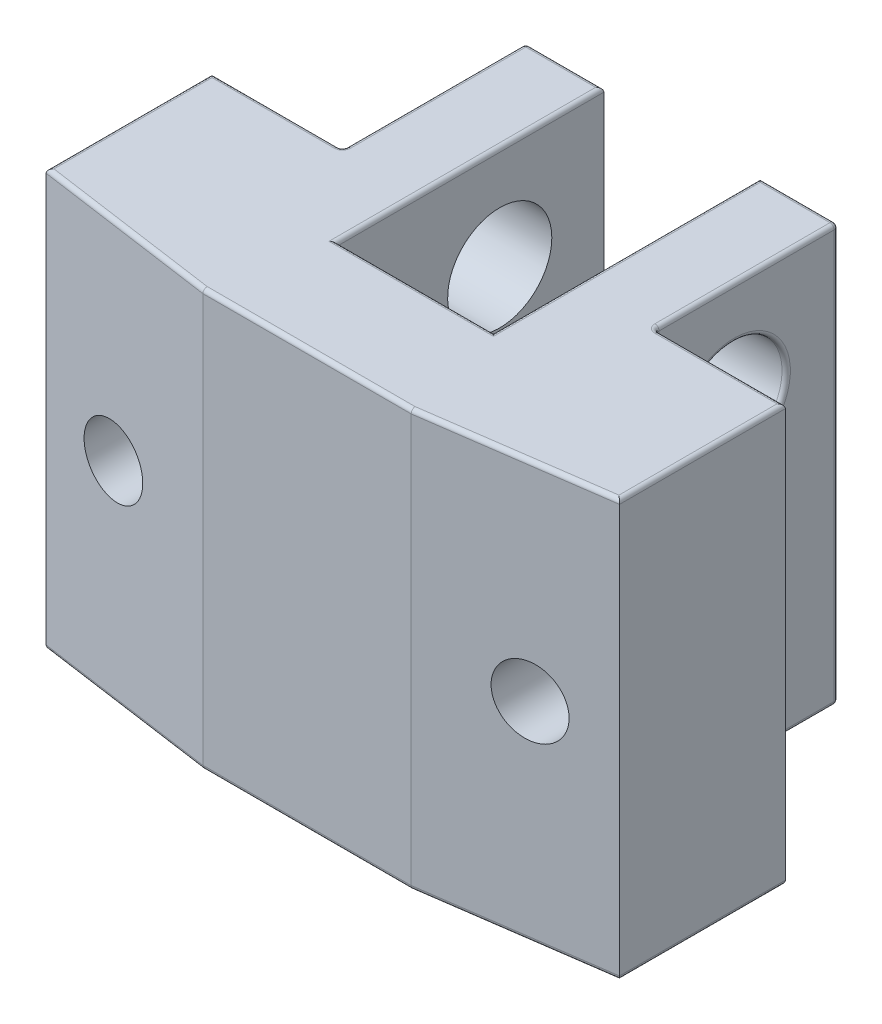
ISO-10303-21;
HEADER;
FILE_DESCRIPTION(('STEP AP214'),'2;1');
FILE_NAME('part.step','',(''),(''),'','','');
FILE_SCHEMA(('AUTOMOTIVE_DESIGN { 1 0 10303 214 1 1 1 1 }'));
ENDSEC;
DATA;
#1=APPLICATION_CONTEXT('core data for automotive mechanical design processes');
#2=APPLICATION_PROTOCOL_DEFINITION('international standard','automotive_design',2000,#1);
#3=PRODUCT_CONTEXT('',#1,'mechanical');
#4=PRODUCT('Part','Part','',(#3));
#5=PRODUCT_RELATED_PRODUCT_CATEGORY('part','',(#4));
#6=PRODUCT_DEFINITION_FORMATION('','',#4);
#7=PRODUCT_DEFINITION_CONTEXT('part definition',#1,'design');
#8=PRODUCT_DEFINITION('design','',#6,#7);
#9=PRODUCT_DEFINITION_SHAPE('','',#8);
#10=(LENGTH_UNIT() NAMED_UNIT(*) SI_UNIT(.MILLI.,.METRE.));
#11=(NAMED_UNIT(*) PLANE_ANGLE_UNIT() SI_UNIT($,.RADIAN.));
#12=(NAMED_UNIT(*) SI_UNIT($,.STERADIAN.) SOLID_ANGLE_UNIT());
#13=UNCERTAINTY_MEASURE_WITH_UNIT(LENGTH_MEASURE(1.E-05),#10,'distance_accuracy_value','');
#14=(GEOMETRIC_REPRESENTATION_CONTEXT(3) GLOBAL_UNCERTAINTY_ASSIGNED_CONTEXT((#13)) GLOBAL_UNIT_ASSIGNED_CONTEXT((#10,
#11,#12)) REPRESENTATION_CONTEXT('',''));
#15=CARTESIAN_POINT('',(0.,0.,0.));
#16=DIRECTION('',(0.,0.,1.));
#17=DIRECTION('',(1.,0.,0.));
#18=AXIS2_PLACEMENT_3D('',#15,#16,#17);
#19=CARTESIAN_POINT('',(17.4752000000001,6.35000000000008,22.86));
#20=DIRECTION('',(0.,-1.,0.));
#21=DIRECTION('',(1.,0.,0.));
#22=AXIS2_PLACEMENT_3D('',#19,#20,#21);
#23=PLANE('',#22);
#24=DIRECTION('',(-0.990129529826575,0.,-0.140155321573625));
#25=VECTOR('',#24,1.);
#26=CARTESIAN_POINT('',(17.0427887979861,6.35000000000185,25.9147759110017));
#27=LINE('',#26,#25);
#28=CARTESIAN_POINT('',(-17.2211999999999,6.35000000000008,21.0646222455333));
#29=VERTEX_POINT('',#28);
#30=CARTESIAN_POINT('',(-6.33211199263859,6.35000000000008,22.606));
#31=VERTEX_POINT('',#30);
#32=EDGE_CURVE('E331',#29,#31,#27,.F.);
#33=ORIENTED_EDGE('',*,*,#32,.T.);
#34=DIRECTION('',(-1.,0.,0.));
#35=VECTOR('',#34,1.);
#36=CARTESIAN_POINT('',(17.4752000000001,6.34999999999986,22.606));
#37=LINE('',#36,#35);
#38=CARTESIAN_POINT('',(6.33211199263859,6.35000000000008,22.606));
#39=VERTEX_POINT('',#38);
#40=EDGE_CURVE('E333',#31,#39,#37,.F.);
#41=ORIENTED_EDGE('',*,*,#40,.T.);
#42=DIRECTION('',(-0.990129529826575,0.,0.140155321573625));
#43=VECTOR('',#42,1.);
#44=CARTESIAN_POINT('',(17.2210625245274,6.35000000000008,21.0646417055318));
#45=LINE('',#44,#43);
#46=CARTESIAN_POINT('',(17.2212000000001,6.35000000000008,21.0646222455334));
#47=VERTEX_POINT('',#46);
#48=EDGE_CURVE('E322',#39,#47,#45,.F.);
#49=ORIENTED_EDGE('',*,*,#48,.T.);
#50=DIRECTION('',(0.,0.,-1.));
#51=VECTOR('',#50,1.);
#52=CARTESIAN_POINT('',(17.2212,6.34999999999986,11.176));
#53=LINE('',#52,#51);
#54=CARTESIAN_POINT('',(17.2212,6.35000000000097,11.43));
#55=VERTEX_POINT('',#54);
#56=EDGE_CURVE('E317',#47,#55,#53,.T.);
#57=ORIENTED_EDGE('',*,*,#56,.T.);
#58=DIRECTION('',(-1.,0.,0.));
#59=VECTOR('',#58,1.);
#60=CARTESIAN_POINT('',(17.4752,6.35000000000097,11.43));
#61=LINE('',#60,#59);
#62=CARTESIAN_POINT('',(9.779,6.35000000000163,11.43));
#63=VERTEX_POINT('',#62);
#64=EDGE_CURVE('E305',#55,#63,#61,.T.);
#65=ORIENTED_EDGE('',*,*,#64,.T.);
#66=CARTESIAN_POINT('',(9.779,6.35000000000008,10.922));
#67=DIRECTION('',(0.,-1.,0.));
#68=DIRECTION('',(1.,0.,0.));
#69=AXIS2_PLACEMENT_3D('',#66,#67,#68);
#70=CIRCLE('',#69,0.508);
#71=CARTESIAN_POINT('',(9.271,6.35000000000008,10.922));
#72=VERTEX_POINT('',#71);
#73=EDGE_CURVE('E302',#72,#63,#70,.F.);
#74=ORIENTED_EDGE('',*,*,#73,.F.);
#75=DIRECTION('',(0.,0.,-1.));
#76=VECTOR('',#75,1.);
#77=CARTESIAN_POINT('',(9.27099999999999,6.35000000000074,22.86));
#78=LINE('',#77,#76);
#79=CARTESIAN_POINT('',(9.27099999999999,6.35000000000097,0.254000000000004));
#80=VERTEX_POINT('',#79);
#81=EDGE_CURVE('E286',#72,#80,#78,.T.);
#82=ORIENTED_EDGE('',*,*,#81,.T.);
#83=DIRECTION('',(-1.,0.,0.));
#84=VECTOR('',#83,1.);
#85=CARTESIAN_POINT('',(4.76250000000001,6.35000000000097,0.254000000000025));
#86=LINE('',#85,#84);
#87=CARTESIAN_POINT('',(5.01650000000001,6.35000000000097,0.254000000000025));
#88=VERTEX_POINT('',#87);
#89=EDGE_CURVE('E307',#80,#88,#86,.T.);
#90=ORIENTED_EDGE('',*,*,#89,.T.);
#91=DIRECTION('',(0.,0.,-1.));
#92=VECTOR('',#91,1.);
#93=CARTESIAN_POINT('',(5.0165,6.35000000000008,16.256));
#94=LINE('',#93,#92);
#95=CARTESIAN_POINT('',(5.01650000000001,6.35000000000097,16.51));
#96=VERTEX_POINT('',#95);
#97=EDGE_CURVE('E309',#88,#96,#94,.F.);
#98=ORIENTED_EDGE('',*,*,#97,.T.);
#99=DIRECTION('',(-1.,0.,0.));
#100=VECTOR('',#99,1.);
#101=CARTESIAN_POINT('',(17.4752000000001,6.35000000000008,16.5100000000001));
#102=LINE('',#101,#100);
#103=CARTESIAN_POINT('',(-5.01649999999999,6.35000000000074,16.5100000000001));
#104=VERTEX_POINT('',#103);
#105=EDGE_CURVE('E311',#96,#104,#102,.T.);
#106=ORIENTED_EDGE('',*,*,#105,.T.);
#107=DIRECTION('',(0.,0.,-1.));
#108=VECTOR('',#107,1.);
#109=CARTESIAN_POINT('',(-5.0165,6.35000000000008,0.));
#110=LINE('',#109,#108);
#111=CARTESIAN_POINT('',(-5.01649999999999,6.35000000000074,0.254000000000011));
#112=VERTEX_POINT('',#111);
#113=EDGE_CURVE('E313',#104,#112,#110,.T.);
#114=ORIENTED_EDGE('',*,*,#113,.T.);
#115=DIRECTION('',(-1.,0.,0.));
#116=VECTOR('',#115,1.);
#117=CARTESIAN_POINT('',(-9.52500000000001,6.35000000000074,0.254000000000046));
#118=LINE('',#117,#116);
#119=CARTESIAN_POINT('',(-9.271,6.35000000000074,0.254000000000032));
#120=VERTEX_POINT('',#119);
#121=EDGE_CURVE('E315',#112,#120,#118,.T.);
#122=ORIENTED_EDGE('',*,*,#121,.T.);
#123=DIRECTION('',(0.,0.,1.));
#124=VECTOR('',#123,1.);
#125=CARTESIAN_POINT('',(-9.271,6.35000000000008,22.86));
#126=LINE('',#125,#124);
#127=CARTESIAN_POINT('',(-9.271,6.34999999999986,10.922));
#128=VERTEX_POINT('',#127);
#129=EDGE_CURVE('E320',#120,#128,#126,.T.);
#130=ORIENTED_EDGE('',*,*,#129,.T.);
#131=CARTESIAN_POINT('',(-9.779,6.34999999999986,10.922));
#132=DIRECTION('',(0.,-1.,0.));
#133=DIRECTION('',(1.,0.,0.));
#134=AXIS2_PLACEMENT_3D('',#131,#132,#133);
#135=CIRCLE('',#134,0.508);
#136=CARTESIAN_POINT('',(-9.779,6.35000000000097,11.43));
#137=VERTEX_POINT('',#136);
#138=EDGE_CURVE('E324',#137,#128,#135,.F.);
#139=ORIENTED_EDGE('',*,*,#138,.F.);
#140=DIRECTION('',(-1.,0.,0.));
#141=VECTOR('',#140,1.);
#142=CARTESIAN_POINT('',(17.4752000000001,6.35000000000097,11.43));
#143=LINE('',#142,#141);
#144=CARTESIAN_POINT('',(-17.2211999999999,6.35000000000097,11.43));
#145=VERTEX_POINT('',#144);
#146=EDGE_CURVE('E327',#137,#145,#143,.T.);
#147=ORIENTED_EDGE('',*,*,#146,.T.);
#148=DIRECTION('',(0.,0.,-1.));
#149=VECTOR('',#148,1.);
#150=CARTESIAN_POINT('',(-17.2211999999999,6.35000000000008,22.86));
#151=LINE('',#150,#149);
#152=EDGE_CURVE('E329',#145,#29,#151,.F.);
#153=ORIENTED_EDGE('',*,*,#152,.T.);
#154=EDGE_LOOP('',(#33,#41,#49,#57,#65,#74,#82,#90,#98,#106,#114,#122,#130,#139,#147,#153));
#155=FACE_BOUND('',#154,.T.);
#156=ADVANCED_FACE('F32',(#155),#23,.F.);
#157=CARTESIAN_POINT('',(-17.4752,6.35000000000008,0.));
#158=DIRECTION('',(0.,0.,-1.));
#159=DIRECTION('',(-1.,0.,0.));
#160=AXIS2_PLACEMENT_3D('',#157,#158,#159);
#161=PLANE('',#160);
#162=DIRECTION('',(0.,-1.,0.));
#163=VECTOR('',#162,1.);
#164=CARTESIAN_POINT('',(-9.271,6.35000000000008,0.));
#165=LINE('',#164,#163);
#166=CARTESIAN_POINT('',(-9.271,-18.796,0.));
#167=VERTEX_POINT('',#166);
#168=CARTESIAN_POINT('',(-9.271,6.0960000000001,0.));
#169=VERTEX_POINT('',#168);
#170=EDGE_CURVE('E366',#167,#169,#165,.F.);
#171=ORIENTED_EDGE('',*,*,#170,.T.);
#172=DIRECTION('',(-1.,0.,0.));
#173=VECTOR('',#172,1.);
#174=CARTESIAN_POINT('',(-4.7625,6.09600000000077,0.));
#175=LINE('',#174,#173);
#176=CARTESIAN_POINT('',(-4.7625,6.09600000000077,0.));
#177=VERTEX_POINT('',#176);
#178=EDGE_CURVE('E370',#169,#177,#175,.F.);
#179=ORIENTED_EDGE('',*,*,#178,.T.);
#180=DIRECTION('',(0.,-1.,0.));
#181=VECTOR('',#180,1.);
#182=CARTESIAN_POINT('',(-4.76249999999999,-5.28319999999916,0.));
#183=LINE('',#182,#181);
#184=CARTESIAN_POINT('',(-4.76249999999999,-5.28319999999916,0.));
#185=VERTEX_POINT('',#184);
#186=EDGE_CURVE('E249',#177,#185,#183,.T.);
#187=ORIENTED_EDGE('',*,*,#186,.T.);
#188=CARTESIAN_POINT('',(0.,-5.28319999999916,0.));
#189=DIRECTION('',(0.,0.,1.));
#190=DIRECTION('',(1.,0.,0.));
#191=AXIS2_PLACEMENT_3D('',#188,#189,#190);
#192=CIRCLE('',#191,4.7625);
#193=CARTESIAN_POINT('',(4.76250000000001,-5.28319999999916,0.));
#194=VERTEX_POINT('',#193);
#195=EDGE_CURVE('E250',#185,#194,#192,.T.);
#196=ORIENTED_EDGE('',*,*,#195,.T.);
#197=DIRECTION('',(0.,1.,0.));
#198=VECTOR('',#197,1.);
#199=CARTESIAN_POINT('',(4.76250000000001,-5.28319999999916,0.));
#200=LINE('',#199,#198);
#201=CARTESIAN_POINT('',(4.7625,6.09600000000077,0.));
#202=VERTEX_POINT('',#201);
#203=EDGE_CURVE('E238',#194,#202,#200,.T.);
#204=ORIENTED_EDGE('',*,*,#203,.T.);
#205=DIRECTION('',(-1.,0.,0.));
#206=VECTOR('',#205,1.);
#207=CARTESIAN_POINT('',(9.525,6.09600000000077,0.));
#208=LINE('',#207,#206);
#209=CARTESIAN_POINT('',(9.271,6.09600000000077,0.));
#210=VERTEX_POINT('',#209);
#211=EDGE_CURVE('E368',#202,#210,#208,.F.);
#212=ORIENTED_EDGE('',*,*,#211,.T.);
#213=DIRECTION('',(0.,-1.,0.));
#214=VECTOR('',#213,1.);
#215=CARTESIAN_POINT('',(9.27099999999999,-19.0499999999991,0.));
#216=LINE('',#215,#214);
#217=CARTESIAN_POINT('',(9.27099999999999,-18.7959999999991,0.));
#218=VERTEX_POINT('',#217);
#219=EDGE_CURVE('E364',#210,#218,#216,.T.);
#220=ORIENTED_EDGE('',*,*,#219,.T.);
#221=DIRECTION('',(1.,0.,0.));
#222=VECTOR('',#221,1.);
#223=CARTESIAN_POINT('',(-9.525,-18.796,0.));
#224=LINE('',#223,#222);
#225=EDGE_CURVE('E362',#218,#167,#224,.F.);
#226=ORIENTED_EDGE('',*,*,#225,.T.);
#227=EDGE_LOOP('',(#171,#179,#187,#196,#204,#212,#220,#226));
#228=FACE_BOUND('',#227,.T.);
#229=ADVANCED_FACE('F263',(#228),#161,.T.);
#230=CARTESIAN_POINT('',(17.4752,0.,6.34999999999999));
#231=DIRECTION('',(-1.,0.,0.));
#232=DIRECTION('',(0.,-1.,0.));
#233=AXIS2_PLACEMENT_3D('',#230,#231,#232);
#234=CYLINDRICAL_SURFACE('',#233,3.17499999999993);
#235=CARTESIAN_POINT('',(9.271,8.88178419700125E-13,6.35000000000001));
#236=DIRECTION('',(-1.,0.,0.));
#237=DIRECTION('',(0.,0.,1.));
#238=AXIS2_PLACEMENT_3D('',#235,#236,#237);
#239=CIRCLE('',#238,3.17499999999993);
#240=CARTESIAN_POINT('',(9.271,8.95889265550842E-13,9.52499999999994));
#241=VERTEX_POINT('',#240);
#242=EDGE_CURVE('E398',#241,#241,#239,.F.);
#243=ORIENTED_EDGE('',*,*,#242,.T.);
#244=EDGE_LOOP('',(#243));
#245=FACE_BOUND('',#244,.T.);
#246=CARTESIAN_POINT('',(4.7625,8.88178419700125E-13,6.35));
#247=DIRECTION('',(-1.,0.,0.));
#248=DIRECTION('',(0.,0.,1.));
#249=AXIS2_PLACEMENT_3D('',#246,#247,#248);
#250=CIRCLE('',#249,3.17499999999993);
#251=CARTESIAN_POINT('',(4.7625,8.95889265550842E-13,9.52499999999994));
#252=VERTEX_POINT('',#251);
#253=EDGE_CURVE('E284',#252,#252,#250,.F.);
#254=ORIENTED_EDGE('',*,*,#253,.F.);
#255=EDGE_LOOP('',(#254));
#256=FACE_BOUND('',#255,.T.);
#257=ADVANCED_FACE('F712',(#245,#256),#234,.F.);
#258=CARTESIAN_POINT('',(-9.271,8.88178419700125E-13,6.35));
#259=DIRECTION('',(1.,0.,0.));
#260=DIRECTION('',(0.,0.,-1.));
#261=AXIS2_PLACEMENT_3D('',#258,#259,#260);
#262=CIRCLE('',#261,3.17499999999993);
#263=CARTESIAN_POINT('',(-9.271,8.80467573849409E-13,3.17500000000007));
#264=VERTEX_POINT('',#263);
#265=EDGE_CURVE('E383',#264,#264,#262,.F.);
#266=ORIENTED_EDGE('',*,*,#265,.T.);
#267=EDGE_LOOP('',(#266));
#268=FACE_BOUND('',#267,.T.);
#269=CARTESIAN_POINT('',(-4.7625,8.88178419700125E-13,6.35000000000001));
#270=DIRECTION('',(1.,0.,0.));
#271=DIRECTION('',(0.,1.,0.));
#272=AXIS2_PLACEMENT_3D('',#269,#270,#271);
#273=CIRCLE('',#272,3.17499999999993);
#274=CARTESIAN_POINT('',(-4.7625,3.17500000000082,6.35000000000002));
#275=VERTEX_POINT('',#274);
#276=EDGE_CURVE('E260',#275,#275,#273,.F.);
#277=ORIENTED_EDGE('',*,*,#276,.F.);
#278=EDGE_LOOP('',(#277));
#279=FACE_BOUND('',#278,.T.);
#280=ADVANCED_FACE('F727',(#268,#279),#234,.F.);
#281=CARTESIAN_POINT('',(-17.4751999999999,6.35000000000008,22.86));
#282=DIRECTION('',(0.,0.,-1.));
#283=DIRECTION('',(-1.,0.,0.));
#284=AXIS2_PLACEMENT_3D('',#281,#282,#283);
#285=PLANE('',#284);
#286=DIRECTION('',(0.,1.,0.));
#287=VECTOR('',#286,1.);
#288=CARTESIAN_POINT('',(6.35000000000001,-19.0499999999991,22.86));
#289=LINE('',#288,#287);
#290=CARTESIAN_POINT('',(6.35000000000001,-18.7959999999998,22.86));
#291=VERTEX_POINT('',#290);
#292=CARTESIAN_POINT('',(6.35,6.09600000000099,22.86));
#293=VERTEX_POINT('',#292);
#294=EDGE_CURVE('E291',#291,#293,#289,.T.);
#295=ORIENTED_EDGE('',*,*,#294,.T.);
#296=DIRECTION('',(-1.,0.,0.));
#297=VECTOR('',#296,1.);
#298=CARTESIAN_POINT('',(-17.4752,6.0960000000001,22.86));
#299=LINE('',#298,#297);
#300=CARTESIAN_POINT('',(-6.35,6.0960000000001,22.86));
#301=VERTEX_POINT('',#300);
#302=EDGE_CURVE('E346',#293,#301,#299,.T.);
#303=ORIENTED_EDGE('',*,*,#302,.T.);
#304=DIRECTION('',(0.,1.,0.));
#305=VECTOR('',#304,1.);
#306=CARTESIAN_POINT('',(-6.34999999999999,-19.05,22.86));
#307=LINE('',#306,#305);
#308=CARTESIAN_POINT('',(-6.34999999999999,-18.796,22.86));
#309=VERTEX_POINT('',#308);
#310=EDGE_CURVE('E272',#309,#301,#307,.T.);
#311=ORIENTED_EDGE('',*,*,#310,.F.);
#312=DIRECTION('',(1.,0.,0.));
#313=VECTOR('',#312,1.);
#314=CARTESIAN_POINT('',(-17.4752,-18.796,22.86));
#315=LINE('',#314,#313);
#316=EDGE_CURVE('E344',#309,#291,#315,.T.);
#317=ORIENTED_EDGE('',*,*,#316,.T.);
#318=EDGE_LOOP('',(#295,#303,#311,#317));
#319=FACE_BOUND('',#318,.T.);
#320=ADVANCED_FACE('F716',(#319),#285,.F.);
#321=CARTESIAN_POINT('',(-17.4751999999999,6.35000000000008,22.86));
#322=DIRECTION('',(1.,0.,0.));
#323=DIRECTION('',(0.,1.,0.));
#324=AXIS2_PLACEMENT_3D('',#321,#322,#323);
#325=PLANE('',#324);
#326=DIRECTION('',(0.,1.,0.));
#327=VECTOR('',#326,1.);
#328=CARTESIAN_POINT('',(-17.4752,-19.05,21.2852));
#329=LINE('',#328,#327);
#330=CARTESIAN_POINT('',(-17.4752,-18.7959999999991,21.2852));
#331=VERTEX_POINT('',#330);
#332=CARTESIAN_POINT('',(-17.4752,6.09599999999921,21.2852));
#333=VERTEX_POINT('',#332);
#334=EDGE_CURVE('E269',#331,#333,#329,.T.);
#335=ORIENTED_EDGE('',*,*,#334,.T.);
#336=DIRECTION('',(0.,0.,-1.));
#337=VECTOR('',#336,1.);
#338=CARTESIAN_POINT('',(-17.4752,6.0960000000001,22.86));
#339=LINE('',#338,#337);
#340=CARTESIAN_POINT('',(-17.4752,6.09599999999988,11.176));
#341=VERTEX_POINT('',#340);
#342=EDGE_CURVE('E354',#333,#341,#339,.T.);
#343=ORIENTED_EDGE('',*,*,#342,.T.);
#344=DIRECTION('',(0.,-1.,0.));
#345=VECTOR('',#344,1.);
#346=CARTESIAN_POINT('',(-17.4752,6.34999999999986,11.176));
#347=LINE('',#346,#345);
#348=CARTESIAN_POINT('',(-17.4752,-18.7959999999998,11.176));
#349=VERTEX_POINT('',#348);
#350=EDGE_CURVE('E296',#341,#349,#347,.T.);
#351=ORIENTED_EDGE('',*,*,#350,.T.);
#352=DIRECTION('',(0.,0.,-1.));
#353=VECTOR('',#352,1.);
#354=CARTESIAN_POINT('',(-17.4752,-18.796,22.86));
#355=LINE('',#354,#353);
#356=EDGE_CURVE('E352',#349,#331,#355,.F.);
#357=ORIENTED_EDGE('',*,*,#356,.T.);
#358=EDGE_LOOP('',(#335,#343,#351,#357));
#359=FACE_BOUND('',#358,.T.);
#360=ADVANCED_FACE('F34',(#359),#325,.F.);
#361=CARTESIAN_POINT('',(-17.4752,-19.05,22.86));
#362=DIRECTION('',(0.,1.,0.));
#363=DIRECTION('',(-1.,0.,0.));
#364=AXIS2_PLACEMENT_3D('',#361,#362,#363);
#365=PLANE('',#364);
#366=DIRECTION('',(0.,0.,-1.));
#367=VECTOR('',#366,1.);
#368=CARTESIAN_POINT('',(-17.2212,-19.05,22.86));
#369=LINE('',#368,#367);
#370=CARTESIAN_POINT('',(-17.2212,-19.05,21.0646222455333));
#371=VERTEX_POINT('',#370);
#372=CARTESIAN_POINT('',(-17.2212,-19.05,11.43));
#373=VERTEX_POINT('',#372);
#374=EDGE_CURVE('E50',#371,#373,#369,.T.);
#375=ORIENTED_EDGE('',*,*,#374,.T.);
#376=DIRECTION('',(-1.,0.,0.));
#377=VECTOR('',#376,1.);
#378=CARTESIAN_POINT('',(-17.4752,-19.05,11.43));
#379=LINE('',#378,#377);
#380=CARTESIAN_POINT('',(-9.77900000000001,-19.05,11.43));
#381=VERTEX_POINT('',#380);
#382=EDGE_CURVE('E11',#373,#381,#379,.F.);
#383=ORIENTED_EDGE('',*,*,#382,.T.);
#384=CARTESIAN_POINT('',(-9.77900000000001,-19.0499999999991,10.922));
#385=DIRECTION('',(0.,1.,0.));
#386=DIRECTION('',(-1.,0.,0.));
#387=AXIS2_PLACEMENT_3D('',#384,#385,#386);
#388=CIRCLE('',#387,0.508);
#389=CARTESIAN_POINT('',(-9.271,-19.0499999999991,10.922));
#390=VERTEX_POINT('',#389);
#391=EDGE_CURVE('E40',#390,#381,#388,.F.);
#392=ORIENTED_EDGE('',*,*,#391,.F.);
#393=DIRECTION('',(0.,0.,1.));
#394=VECTOR('',#393,1.);
#395=CARTESIAN_POINT('',(-9.27100000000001,-19.05,22.86));
#396=LINE('',#395,#394);
#397=CARTESIAN_POINT('',(-9.271,-19.05,0.254000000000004));
#398=VERTEX_POINT('',#397);
#399=EDGE_CURVE('E417',#390,#398,#396,.F.);
#400=ORIENTED_EDGE('',*,*,#399,.T.);
#401=DIRECTION('',(1.,0.,0.));
#402=VECTOR('',#401,1.);
#403=CARTESIAN_POINT('',(9.525,-19.05,0.253999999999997));
#404=LINE('',#403,#402);
#405=CARTESIAN_POINT('',(9.27099999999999,-19.05,0.253999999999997));
#406=VERTEX_POINT('',#405);
#407=EDGE_CURVE('E413',#398,#406,#404,.T.);
#408=ORIENTED_EDGE('',*,*,#407,.T.);
#409=DIRECTION('',(0.,0.,-1.));
#410=VECTOR('',#409,1.);
#411=CARTESIAN_POINT('',(9.271,-19.0499999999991,22.86));
#412=LINE('',#411,#410);
#413=CARTESIAN_POINT('',(9.27099999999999,-19.0499999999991,10.922));
#414=VERTEX_POINT('',#413);
#415=EDGE_CURVE('E415',#406,#414,#412,.F.);
#416=ORIENTED_EDGE('',*,*,#415,.T.);
#417=CARTESIAN_POINT('',(9.779,-19.0499999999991,10.922));
#418=DIRECTION('',(0.,1.,0.));
#419=DIRECTION('',(-1.,0.,0.));
#420=AXIS2_PLACEMENT_3D('',#417,#418,#419);
#421=CIRCLE('',#420,0.508);
#422=CARTESIAN_POINT('',(9.779,-19.0499999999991,11.43));
#423=VERTEX_POINT('',#422);
#424=EDGE_CURVE('E420',#423,#414,#421,.F.);
#425=ORIENTED_EDGE('',*,*,#424,.F.);
#426=DIRECTION('',(-1.,0.,0.));
#427=VECTOR('',#426,1.);
#428=CARTESIAN_POINT('',(-17.4752,-19.05,11.43));
#429=LINE('',#428,#427);
#430=CARTESIAN_POINT('',(17.2212,-19.05,11.43));
#431=VERTEX_POINT('',#430);
#432=EDGE_CURVE('E423',#423,#431,#429,.F.);
#433=ORIENTED_EDGE('',*,*,#432,.T.);
#434=DIRECTION('',(0.,0.,-1.));
#435=VECTOR('',#434,1.);
#436=CARTESIAN_POINT('',(17.2212,-19.05,21.2852));
#437=LINE('',#436,#435);
#438=CARTESIAN_POINT('',(17.2212,-19.05,21.0646222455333));
#439=VERTEX_POINT('',#438);
#440=EDGE_CURVE('E425',#431,#439,#437,.F.);
#441=ORIENTED_EDGE('',*,*,#440,.T.);
#442=DIRECTION('',(-0.990129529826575,0.,0.140155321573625));
#443=VECTOR('',#442,1.);
#444=CARTESIAN_POINT('',(-17.0427887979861,-19.05,25.9147759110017));
#445=LINE('',#444,#443);
#446=CARTESIAN_POINT('',(6.33211199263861,-19.0499999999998,22.606));
#447=VERTEX_POINT('',#446);
#448=EDGE_CURVE('E427',#439,#447,#445,.T.);
#449=ORIENTED_EDGE('',*,*,#448,.T.);
#450=DIRECTION('',(1.,0.,0.));
#451=VECTOR('',#450,1.);
#452=CARTESIAN_POINT('',(-17.4752,-19.05,22.606));
#453=LINE('',#452,#451);
#454=CARTESIAN_POINT('',(-6.3321119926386,-19.05,22.606));
#455=VERTEX_POINT('',#454);
#456=EDGE_CURVE('E429',#447,#455,#453,.F.);
#457=ORIENTED_EDGE('',*,*,#456,.T.);
#458=DIRECTION('',(-0.990129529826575,0.,-0.140155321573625));
#459=VECTOR('',#458,1.);
#460=CARTESIAN_POINT('',(-17.2210625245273,-19.05,21.0646417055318));
#461=LINE('',#460,#459);
#462=EDGE_CURVE('E431',#455,#371,#461,.T.);
#463=ORIENTED_EDGE('',*,*,#462,.T.);
#464=EDGE_LOOP('',(#375,#383,#392,#400,#408,#416,#425,#433,#441,#449,#457,#463));
#465=FACE_BOUND('',#464,.T.);
#466=ADVANCED_FACE('F444',(#465),#365,.F.);
#467=CARTESIAN_POINT('',(17.4752000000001,6.35000000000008,22.86));
#468=DIRECTION('',(1.,0.,0.));
#469=DIRECTION('',(0.,1.,0.));
#470=AXIS2_PLACEMENT_3D('',#467,#468,#469);
#471=PLANE('',#470);
#472=DIRECTION('',(0.,-1.,0.));
#473=VECTOR('',#472,1.);
#474=CARTESIAN_POINT('',(17.4752000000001,6.34999999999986,11.176));
#475=LINE('',#474,#473);
#476=CARTESIAN_POINT('',(17.4752000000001,6.09600000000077,11.176));
#477=VERTEX_POINT('',#476);
#478=CARTESIAN_POINT('',(17.4752,-18.7959999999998,11.176));
#479=VERTEX_POINT('',#478);
#480=EDGE_CURVE('E300',#477,#479,#475,.T.);
#481=ORIENTED_EDGE('',*,*,#480,.F.);
#482=DIRECTION('',(0.,0.,-1.));
#483=VECTOR('',#482,1.);
#484=CARTESIAN_POINT('',(17.4752,6.09599999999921,21.2852));
#485=LINE('',#484,#483);
#486=CARTESIAN_POINT('',(17.4752,6.09599999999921,21.2852));
#487=VERTEX_POINT('',#486);
#488=EDGE_CURVE('E337',#477,#487,#485,.F.);
#489=ORIENTED_EDGE('',*,*,#488,.T.);
#490=DIRECTION('',(0.,1.,0.));
#491=VECTOR('',#490,1.);
#492=CARTESIAN_POINT('',(17.4752,-19.05,21.2852));
#493=LINE('',#492,#491);
#494=CARTESIAN_POINT('',(17.4752,-18.7959999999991,21.2852));
#495=VERTEX_POINT('',#494);
#496=EDGE_CURVE('E295',#495,#487,#493,.T.);
#497=ORIENTED_EDGE('',*,*,#496,.F.);
#498=DIRECTION('',(0.,0.,-1.));
#499=VECTOR('',#498,1.);
#500=CARTESIAN_POINT('',(17.4752,-18.7959999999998,11.176));
#501=LINE('',#500,#499);
#502=EDGE_CURVE('E335',#495,#479,#501,.T.);
#503=ORIENTED_EDGE('',*,*,#502,.T.);
#504=EDGE_LOOP('',(#481,#489,#497,#503));
#505=FACE_BOUND('',#504,.T.);
#506=ADVANCED_FACE('F717',(#505),#471,.T.);
#507=CARTESIAN_POINT('',(4.7625,-5.28319999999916,16.256));
#508=DIRECTION('',(-1.,0.,0.));
#509=DIRECTION('',(0.,0.,1.));
#510=AXIS2_PLACEMENT_3D('',#507,#508,#509);
#511=PLANE('',#510);
#512=DIRECTION('',(0.,1.,0.));
#513=VECTOR('',#512,1.);
#514=CARTESIAN_POINT('',(4.7625,-5.28319999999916,16.256));
#515=LINE('',#514,#513);
#516=CARTESIAN_POINT('',(4.7625,-5.28319999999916,16.256));
#517=VERTEX_POINT('',#516);
#518=CARTESIAN_POINT('',(4.7625,6.09600000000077,16.256));
#519=VERTEX_POINT('',#518);
#520=EDGE_CURVE('E277',#517,#519,#515,.T.);
#521=ORIENTED_EDGE('',*,*,#520,.T.);
#522=DIRECTION('',(0.,0.,-1.));
#523=VECTOR('',#522,1.);
#524=CARTESIAN_POINT('',(4.7625,6.09600000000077,0.));
#525=LINE('',#524,#523);
#526=EDGE_CURVE('E245',#519,#202,#525,.T.);
#527=ORIENTED_EDGE('',*,*,#526,.T.);
#528=ORIENTED_EDGE('',*,*,#203,.F.);
#529=DIRECTION('',(0.,0.,-1.));
#530=VECTOR('',#529,1.);
#531=CARTESIAN_POINT('',(4.7625,-5.28319999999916,16.256));
#532=LINE('',#531,#530);
#533=EDGE_CURVE('E243',#517,#194,#532,.T.);
#534=ORIENTED_EDGE('',*,*,#533,.F.);
#535=EDGE_LOOP('',(#521,#527,#528,#534));
#536=FACE_BOUND('',#535,.T.);
#537=ORIENTED_EDGE('',*,*,#253,.T.);
#538=EDGE_LOOP('',(#537));
#539=FACE_BOUND('',#538,.T.);
#540=ADVANCED_FACE('F241',(#536,#539),#511,.T.);
#541=CARTESIAN_POINT('',(-4.7625,-5.28319999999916,16.256));
#542=DIRECTION('',(1.,0.,0.));
#543=DIRECTION('',(0.,1.,0.));
#544=AXIS2_PLACEMENT_3D('',#541,#542,#543);
#545=PLANE('',#544);
#546=ORIENTED_EDGE('',*,*,#186,.F.);
#547=DIRECTION('',(0.,0.,-1.));
#548=VECTOR('',#547,1.);
#549=CARTESIAN_POINT('',(-4.7625,6.0960000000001,16.256));
#550=LINE('',#549,#548);
#551=CARTESIAN_POINT('',(-4.7625,6.0960000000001,16.256));
#552=VERTEX_POINT('',#551);
#553=EDGE_CURVE('E372',#177,#552,#550,.F.);
#554=ORIENTED_EDGE('',*,*,#553,.T.);
#555=DIRECTION('',(0.,-1.,0.));
#556=VECTOR('',#555,1.);
#557=CARTESIAN_POINT('',(-4.7625,-5.28319999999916,16.256));
#558=LINE('',#557,#556);
#559=CARTESIAN_POINT('',(-4.7625,-5.28319999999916,16.256));
#560=VERTEX_POINT('',#559);
#561=EDGE_CURVE('E279',#552,#560,#558,.T.);
#562=ORIENTED_EDGE('',*,*,#561,.T.);
#563=DIRECTION('',(0.,0.,-1.));
#564=VECTOR('',#563,1.);
#565=CARTESIAN_POINT('',(-4.7625,-5.28319999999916,16.256));
#566=LINE('',#565,#564);
#567=EDGE_CURVE('E261',#560,#185,#566,.T.);
#568=ORIENTED_EDGE('',*,*,#567,.T.);
#569=EDGE_LOOP('',(#546,#554,#562,#568));
#570=FACE_BOUND('',#569,.T.);
#571=ORIENTED_EDGE('',*,*,#276,.T.);
#572=EDGE_LOOP('',(#571));
#573=FACE_BOUND('',#572,.T.);
#574=ADVANCED_FACE('F671',(#570,#573),#545,.T.);
#575=CARTESIAN_POINT('',(0.,-5.28319999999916,16.256));
#576=DIRECTION('',(0.,0.,-1.));
#577=DIRECTION('',(-1.,0.,0.));
#578=AXIS2_PLACEMENT_3D('',#575,#576,#577);
#579=CYLINDRICAL_SURFACE('',#578,4.7625);
#580=ORIENTED_EDGE('',*,*,#195,.F.);
#581=ORIENTED_EDGE('',*,*,#567,.F.);
#582=CARTESIAN_POINT('',(0.,-5.28319999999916,16.256));
#583=DIRECTION('',(0.,0.,1.));
#584=DIRECTION('',(1.,0.,0.));
#585=AXIS2_PLACEMENT_3D('',#582,#583,#584);
#586=CIRCLE('',#585,4.7625);
#587=EDGE_CURVE('E259',#560,#517,#586,.T.);
#588=ORIENTED_EDGE('',*,*,#587,.T.);
#589=ORIENTED_EDGE('',*,*,#533,.T.);
#590=EDGE_LOOP('',(#580,#581,#588,#589));
#591=FACE_BOUND('',#590,.T.);
#592=ADVANCED_FACE('F255',(#591),#579,.F.);
#593=CARTESIAN_POINT('',(0.,-5.28319999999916,16.256));
#594=DIRECTION('',(0.,0.,1.));
#595=DIRECTION('',(1.,0.,0.));
#596=AXIS2_PLACEMENT_3D('',#593,#594,#595);
#597=PLANE('',#596);
#598=ORIENTED_EDGE('',*,*,#561,.F.);
#599=DIRECTION('',(-1.,0.,0.));
#600=VECTOR('',#599,1.);
#601=CARTESIAN_POINT('',(0.,6.09600000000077,16.256));
#602=LINE('',#601,#600);
#603=EDGE_CURVE('E374',#552,#519,#602,.F.);
#604=ORIENTED_EDGE('',*,*,#603,.T.);
#605=ORIENTED_EDGE('',*,*,#520,.F.);
#606=ORIENTED_EDGE('',*,*,#587,.F.);
#607=EDGE_LOOP('',(#598,#604,#605,#606));
#608=FACE_BOUND('',#607,.T.);
#609=ADVANCED_FACE('F675',(#608),#597,.F.);
#610=CARTESIAN_POINT('',(-17.4752,-19.05,21.2852));
#611=DIRECTION('',(0.140155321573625,0.,-0.990129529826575));
#612=DIRECTION('',(-0.990129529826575,0.,-0.140155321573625));
#613=AXIS2_PLACEMENT_3D('',#610,#611,#612);
#614=PLANE('',#613);
#615=CARTESIAN_POINT('',(-12.7,-6.35000000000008,21.9611415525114));
#616=DIRECTION('',(0.140155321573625,0.,-0.990129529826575));
#617=DIRECTION('',(0.990129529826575,0.,0.140155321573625));
#618=AXIS2_PLACEMENT_3D('',#615,#616,#617);
#619=ELLIPSE('',#618,2.10356315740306,2.0828);
#620=CARTESIAN_POINT('',(-10.6172,-6.35000000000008,22.2559671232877));
#621=VERTEX_POINT('',#620);
#622=EDGE_CURVE('E266',#621,#621,#619,.T.);
#623=ORIENTED_EDGE('',*,*,#622,.T.);
#624=EDGE_LOOP('',(#623));
#625=FACE_BOUND('',#624,.T.);
#626=ORIENTED_EDGE('',*,*,#310,.T.);
#627=DIRECTION('',(-0.990129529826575,0.,-0.140155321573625));
#628=VECTOR('',#627,1.);
#629=CARTESIAN_POINT('',(-17.4752,6.09599999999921,21.2852));
#630=LINE('',#629,#628);
#631=EDGE_CURVE('E350',#301,#333,#630,.T.);
#632=ORIENTED_EDGE('',*,*,#631,.T.);
#633=ORIENTED_EDGE('',*,*,#334,.F.);
#634=DIRECTION('',(-0.990129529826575,0.,-0.140155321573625));
#635=VECTOR('',#634,1.);
#636=CARTESIAN_POINT('',(-17.4752,-18.7959999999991,21.2852));
#637=LINE('',#636,#635);
#638=EDGE_CURVE('E348',#331,#309,#637,.F.);
#639=ORIENTED_EDGE('',*,*,#638,.T.);
#640=EDGE_LOOP('',(#626,#632,#633,#639));
#641=FACE_BOUND('',#640,.T.);
#642=ADVANCED_FACE('F495',(#625,#641),#614,.F.);
#643=CARTESIAN_POINT('',(-12.7,-6.34999999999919,10.16));
#644=DIRECTION('',(0.,0.,1.));
#645=DIRECTION('',(1.,0.,0.));
#646=AXIS2_PLACEMENT_3D('',#643,#644,#645);
#647=CYLINDRICAL_SURFACE('',#646,2.0828);
#648=CARTESIAN_POINT('',(-12.7,-6.34999999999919,11.176));
#649=DIRECTION('',(0.,0.,1.));
#650=DIRECTION('',(1.,0.,0.));
#651=AXIS2_PLACEMENT_3D('',#648,#649,#650);
#652=CIRCLE('',#651,2.0828);
#653=CARTESIAN_POINT('',(-10.6172,-6.34999999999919,11.176));
#654=VERTEX_POINT('',#653);
#655=EDGE_CURVE('E292',#654,#654,#652,.T.);
#656=ORIENTED_EDGE('',*,*,#655,.F.);
#657=EDGE_LOOP('',(#656));
#658=FACE_BOUND('',#657,.T.);
#659=ORIENTED_EDGE('',*,*,#622,.F.);
#660=EDGE_LOOP('',(#659));
#661=FACE_BOUND('',#660,.T.);
#662=ADVANCED_FACE('F939',(#658,#661),#647,.F.);
#663=CARTESIAN_POINT('',(17.4752,-19.05,21.2852));
#664=DIRECTION('',(-0.140155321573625,0.,-0.990129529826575));
#665=DIRECTION('',(-0.990129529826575,0.,0.140155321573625));
#666=AXIS2_PLACEMENT_3D('',#663,#664,#665);
#667=PLANE('',#666);
#668=ORIENTED_EDGE('',*,*,#496,.T.);
#669=DIRECTION('',(-0.990129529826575,0.,0.140155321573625));
#670=VECTOR('',#669,1.);
#671=CARTESIAN_POINT('',(17.4752,6.09599999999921,21.2852));
#672=LINE('',#671,#670);
#673=EDGE_CURVE('E342',#487,#293,#672,.T.);
#674=ORIENTED_EDGE('',*,*,#673,.T.);
#675=ORIENTED_EDGE('',*,*,#294,.F.);
#676=DIRECTION('',(-0.990129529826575,0.,0.140155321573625));
#677=VECTOR('',#676,1.);
#678=CARTESIAN_POINT('',(17.4752,-18.7959999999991,21.2852));
#679=LINE('',#678,#677);
#680=EDGE_CURVE('E340',#291,#495,#679,.F.);
#681=ORIENTED_EDGE('',*,*,#680,.T.);
#682=EDGE_LOOP('',(#668,#674,#675,#681));
#683=FACE_BOUND('',#682,.T.);
#684=CARTESIAN_POINT('',(12.7,-6.34999999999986,21.9611415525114));
#685=DIRECTION('',(-0.140155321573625,0.,-0.990129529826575));
#686=DIRECTION('',(-0.990129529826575,0.,0.140155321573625));
#687=AXIS2_PLACEMENT_3D('',#684,#685,#686);
#688=ELLIPSE('',#687,2.10356315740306,2.0828);
#689=CARTESIAN_POINT('',(10.6172,-6.34999999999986,22.2559671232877));
#690=VERTEX_POINT('',#689);
#691=EDGE_CURVE('E288',#690,#690,#688,.F.);
#692=ORIENTED_EDGE('',*,*,#691,.F.);
#693=EDGE_LOOP('',(#692));
#694=FACE_BOUND('',#693,.T.);
#695=ADVANCED_FACE('F735',(#683,#694),#667,.F.);
#696=CARTESIAN_POINT('',(12.7,-6.34999999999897,10.16));
#697=DIRECTION('',(0.,0.,1.));
#698=DIRECTION('',(1.,0.,0.));
#699=AXIS2_PLACEMENT_3D('',#696,#697,#698);
#700=CYLINDRICAL_SURFACE('',#699,2.0828);
#701=CARTESIAN_POINT('',(12.7,-6.34999999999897,11.176));
#702=DIRECTION('',(0.,0.,1.));
#703=DIRECTION('',(1.,0.,0.));
#704=AXIS2_PLACEMENT_3D('',#701,#702,#703);
#705=CIRCLE('',#704,2.0828);
#706=CARTESIAN_POINT('',(14.7828,-6.34999999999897,11.176));
#707=VERTEX_POINT('',#706);
#708=EDGE_CURVE('E297',#707,#707,#705,.F.);
#709=ORIENTED_EDGE('',*,*,#708,.T.);
#710=EDGE_LOOP('',(#709));
#711=FACE_BOUND('',#710,.T.);
#712=ORIENTED_EDGE('',*,*,#691,.T.);
#713=EDGE_LOOP('',(#712));
#714=FACE_BOUND('',#713,.T.);
#715=ADVANCED_FACE('F935',(#711,#714),#700,.F.);
#716=CARTESIAN_POINT('',(-9.525,6.35000000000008,0.));
#717=DIRECTION('',(1.,0.,0.));
#718=DIRECTION('',(0.,0.,-1.));
#719=AXIS2_PLACEMENT_3D('',#716,#717,#718);
#720=PLANE('',#719);
#721=CARTESIAN_POINT('',(-9.525,0.,6.34999999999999));
#722=DIRECTION('',(1.,0.,0.));
#723=DIRECTION('',(0.,0.,-1.));
#724=AXIS2_PLACEMENT_3D('',#721,#722,#723);
#725=CIRCLE('',#724,3.42899999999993);
#726=CARTESIAN_POINT('',(-9.525,0.,2.92100000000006));
#727=VERTEX_POINT('',#726);
#728=EDGE_CURVE('E395',#727,#727,#725,.T.);
#729=ORIENTED_EDGE('',*,*,#728,.T.);
#730=EDGE_LOOP('',(#729));
#731=FACE_BOUND('',#730,.T.);
#732=DIRECTION('',(0.,0.,1.));
#733=VECTOR('',#732,1.);
#734=CARTESIAN_POINT('',(-9.525,6.0960000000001,0.));
#735=LINE('',#734,#733);
#736=CARTESIAN_POINT('',(-9.525,6.09600000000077,10.922));
#737=VERTEX_POINT('',#736);
#738=CARTESIAN_POINT('',(-9.525,6.09600000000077,0.254000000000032));
#739=VERTEX_POINT('',#738);
#740=EDGE_CURVE('E390',#737,#739,#735,.F.);
#741=ORIENTED_EDGE('',*,*,#740,.T.);
#742=DIRECTION('',(0.,-1.,0.));
#743=VECTOR('',#742,1.);
#744=CARTESIAN_POINT('',(-9.525,-19.05,0.25399999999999));
#745=LINE('',#744,#743);
#746=CARTESIAN_POINT('',(-9.525,-18.796,0.25399999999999));
#747=VERTEX_POINT('',#746);
#748=EDGE_CURVE('E392',#739,#747,#745,.T.);
#749=ORIENTED_EDGE('',*,*,#748,.T.);
#750=DIRECTION('',(0.,0.,1.));
#751=VECTOR('',#750,1.);
#752=CARTESIAN_POINT('',(-9.525,-18.796,0.));
#753=LINE('',#752,#751);
#754=CARTESIAN_POINT('',(-9.52500000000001,-18.7959999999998,10.922));
#755=VERTEX_POINT('',#754);
#756=EDGE_CURVE('E386',#747,#755,#753,.T.);
#757=ORIENTED_EDGE('',*,*,#756,.T.);
#758=DIRECTION('',(0.,-1.,0.));
#759=VECTOR('',#758,1.);
#760=CARTESIAN_POINT('',(-9.525,6.34999999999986,10.922));
#761=LINE('',#760,#759);
#762=EDGE_CURVE('E388',#755,#737,#761,.F.);
#763=ORIENTED_EDGE('',*,*,#762,.T.);
#764=EDGE_LOOP('',(#741,#749,#757,#763));
#765=FACE_BOUND('',#764,.T.);
#766=ADVANCED_FACE('F590',(#731,#765),#720,.F.);
#767=CARTESIAN_POINT('',(-17.4752,6.34999999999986,11.176));
#768=DIRECTION('',(0.,0.,1.));
#769=DIRECTION('',(1.,0.,0.));
#770=AXIS2_PLACEMENT_3D('',#767,#768,#769);
#771=PLANE('',#770);
#772=ORIENTED_EDGE('',*,*,#655,.T.);
#773=EDGE_LOOP('',(#772));
#774=FACE_BOUND('',#773,.T.);
#775=ORIENTED_EDGE('',*,*,#350,.F.);
#776=DIRECTION('',(-1.,0.,0.));
#777=VECTOR('',#776,1.);
#778=CARTESIAN_POINT('',(-17.4752,6.09599999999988,11.176));
#779=LINE('',#778,#777);
#780=CARTESIAN_POINT('',(-9.77900000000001,6.09600000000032,11.176));
#781=VERTEX_POINT('',#780);
#782=EDGE_CURVE('E360',#341,#781,#779,.F.);
#783=ORIENTED_EDGE('',*,*,#782,.T.);
#784=DIRECTION('',(0.,-1.,0.));
#785=VECTOR('',#784,1.);
#786=CARTESIAN_POINT('',(-9.77900000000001,-19.05,11.176));
#787=LINE('',#786,#785);
#788=CARTESIAN_POINT('',(-9.77900000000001,-18.7959999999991,11.176));
#789=VERTEX_POINT('',#788);
#790=EDGE_CURVE('E358',#781,#789,#787,.T.);
#791=ORIENTED_EDGE('',*,*,#790,.T.);
#792=DIRECTION('',(-1.,0.,0.));
#793=VECTOR('',#792,1.);
#794=CARTESIAN_POINT('',(-17.4752,-18.7959999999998,11.176));
#795=LINE('',#794,#793);
#796=EDGE_CURVE('E356',#789,#349,#795,.T.);
#797=ORIENTED_EDGE('',*,*,#796,.T.);
#798=EDGE_LOOP('',(#775,#783,#791,#797));
#799=FACE_BOUND('',#798,.T.);
#800=ADVANCED_FACE('F651',(#774,#799),#771,.F.);
#801=CARTESIAN_POINT('',(9.525,6.35000000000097,0.));
#802=DIRECTION('',(-1.,0.,0.));
#803=DIRECTION('',(0.,0.,1.));
#804=AXIS2_PLACEMENT_3D('',#801,#802,#803);
#805=PLANE('',#804);
#806=CARTESIAN_POINT('',(9.525,8.88178419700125E-13,6.35000000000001));
#807=DIRECTION('',(-1.,0.,0.));
#808=DIRECTION('',(0.,0.,1.));
#809=AXIS2_PLACEMENT_3D('',#806,#807,#808);
#810=CIRCLE('',#809,3.42899999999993);
#811=CARTESIAN_POINT('',(9.525,8.96506133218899E-13,9.77899999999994));
#812=VERTEX_POINT('',#811);
#813=EDGE_CURVE('E410',#812,#812,#810,.T.);
#814=ORIENTED_EDGE('',*,*,#813,.T.);
#815=EDGE_LOOP('',(#814));
#816=FACE_BOUND('',#815,.T.);
#817=DIRECTION('',(0.,0.,-1.));
#818=VECTOR('',#817,1.);
#819=CARTESIAN_POINT('',(9.525,6.09600000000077,0.));
#820=LINE('',#819,#818);
#821=CARTESIAN_POINT('',(9.525,6.09600000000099,0.254000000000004));
#822=VERTEX_POINT('',#821);
#823=CARTESIAN_POINT('',(9.525,6.09600000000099,10.922));
#824=VERTEX_POINT('',#823);
#825=EDGE_CURVE('E405',#822,#824,#820,.F.);
#826=ORIENTED_EDGE('',*,*,#825,.T.);
#827=DIRECTION('',(0.,-1.,0.));
#828=VECTOR('',#827,1.);
#829=CARTESIAN_POINT('',(9.525,-19.0499999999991,10.922));
#830=LINE('',#829,#828);
#831=CARTESIAN_POINT('',(9.525,-18.7959999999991,10.922));
#832=VERTEX_POINT('',#831);
#833=EDGE_CURVE('E407',#824,#832,#830,.T.);
#834=ORIENTED_EDGE('',*,*,#833,.T.);
#835=DIRECTION('',(0.,0.,-1.));
#836=VECTOR('',#835,1.);
#837=CARTESIAN_POINT('',(9.52499999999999,-18.7959999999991,0.));
#838=LINE('',#837,#836);
#839=CARTESIAN_POINT('',(9.52499999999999,-18.7959999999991,0.253999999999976));
#840=VERTEX_POINT('',#839);
#841=EDGE_CURVE('E401',#832,#840,#838,.T.);
#842=ORIENTED_EDGE('',*,*,#841,.T.);
#843=DIRECTION('',(0.,-1.,0.));
#844=VECTOR('',#843,1.);
#845=CARTESIAN_POINT('',(9.52499999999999,6.35000000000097,0.254000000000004));
#846=LINE('',#845,#844);
#847=EDGE_CURVE('E403',#840,#822,#846,.F.);
#848=ORIENTED_EDGE('',*,*,#847,.T.);
#849=EDGE_LOOP('',(#826,#834,#842,#848));
#850=FACE_BOUND('',#849,.T.);
#851=ADVANCED_FACE('F954',(#816,#850),#805,.F.);
#852=CARTESIAN_POINT('',(17.4752000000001,6.34999999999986,11.176));
#853=DIRECTION('',(0.,0.,1.));
#854=DIRECTION('',(1.,0.,0.));
#855=AXIS2_PLACEMENT_3D('',#852,#853,#854);
#856=PLANE('',#855);
#857=DIRECTION('',(0.,-1.,0.));
#858=VECTOR('',#857,1.);
#859=CARTESIAN_POINT('',(9.77899999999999,6.35000000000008,11.176));
#860=LINE('',#859,#858);
#861=CARTESIAN_POINT('',(9.779,-18.7959999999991,11.176));
#862=VERTEX_POINT('',#861);
#863=CARTESIAN_POINT('',(9.77899999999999,6.09600000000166,11.176));
#864=VERTEX_POINT('',#863);
#865=EDGE_CURVE('E379',#862,#864,#860,.F.);
#866=ORIENTED_EDGE('',*,*,#865,.T.);
#867=DIRECTION('',(-1.,0.,0.));
#868=VECTOR('',#867,1.);
#869=CARTESIAN_POINT('',(17.4752000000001,6.09600000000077,11.176));
#870=LINE('',#869,#868);
#871=EDGE_CURVE('E381',#864,#477,#870,.F.);
#872=ORIENTED_EDGE('',*,*,#871,.T.);
#873=ORIENTED_EDGE('',*,*,#480,.T.);
#874=DIRECTION('',(-1.,0.,0.));
#875=VECTOR('',#874,1.);
#876=CARTESIAN_POINT('',(17.4752,-18.7959999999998,11.176));
#877=LINE('',#876,#875);
#878=EDGE_CURVE('E377',#479,#862,#877,.T.);
#879=ORIENTED_EDGE('',*,*,#878,.T.);
#880=EDGE_LOOP('',(#866,#872,#873,#879));
#881=FACE_BOUND('',#880,.T.);
#882=ORIENTED_EDGE('',*,*,#708,.F.);
#883=EDGE_LOOP('',(#882));
#884=FACE_BOUND('',#883,.T.);
#885=ADVANCED_FACE('F960',(#881,#884),#856,.F.);
#886=CARTESIAN_POINT('',(-17.2212,-18.796,22.86));
#887=DIRECTION('',(0.,0.,-1.));
#888=DIRECTION('',(-1.,0.,0.));
#889=AXIS2_PLACEMENT_3D('',#886,#887,#888);
#890=CYLINDRICAL_SURFACE('',#889,0.254);
#891=CARTESIAN_POINT('',(-17.2212,-18.7959999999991,21.0646222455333));
#892=DIRECTION('',(-0.65568463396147,0.,-0.755034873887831));
#893=DIRECTION('',(-0.755034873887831,0.,0.65568463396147));
#894=AXIS2_PLACEMENT_3D('',#891,#892,#893);
#895=ELLIPSE('',#894,0.33640830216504,0.254);
#896=EDGE_CURVE('E474',#331,#371,#895,.F.);
#897=ORIENTED_EDGE('',*,*,#896,.F.);
#898=ORIENTED_EDGE('',*,*,#356,.F.);
#899=CARTESIAN_POINT('',(-17.2212,-18.796,11.43));
#900=DIRECTION('',(0.707106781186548,0.,-0.707106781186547));
#901=DIRECTION('',(-0.707106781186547,0.,-0.707106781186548));
#902=AXIS2_PLACEMENT_3D('',#899,#900,#901);
#903=ELLIPSE('',#902,0.359210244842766,0.254);
#904=EDGE_CURVE('E477',#373,#349,#903,.T.);
#905=ORIENTED_EDGE('',*,*,#904,.F.);
#906=ORIENTED_EDGE('',*,*,#374,.F.);
#907=EDGE_LOOP('',(#897,#898,#905,#906));
#908=FACE_BOUND('',#907,.T.);
#909=ADVANCED_FACE('F644',(#908),#890,.T.);
#910=CARTESIAN_POINT('',(17.4752,6.0960000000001,0.253999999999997));
#911=DIRECTION('',(1.,0.,0.));
#912=DIRECTION('',(0.,1.,0.));
#913=AXIS2_PLACEMENT_3D('',#910,#911,#912);
#914=CYLINDRICAL_SURFACE('',#913,0.254);
#915=CARTESIAN_POINT('',(-5.0165,6.09600000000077,0.254000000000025));
#916=DIRECTION('',(0.707106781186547,0.,0.707106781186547));
#917=DIRECTION('',(-0.707106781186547,0.,0.707106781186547));
#918=AXIS2_PLACEMENT_3D('',#915,#916,#917);
#919=ELLIPSE('',#918,0.359210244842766,0.254);
#920=EDGE_CURVE('E457',#177,#112,#919,.T.);
#921=ORIENTED_EDGE('',*,*,#920,.F.);
#922=ORIENTED_EDGE('',*,*,#178,.F.);
#923=CARTESIAN_POINT('',(-9.271,6.09600000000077,0.254000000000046));
#924=DIRECTION('',(-1.,0.,0.));
#925=DIRECTION('',(0.,0.,1.));
#926=AXIS2_PLACEMENT_3D('',#923,#924,#925);
#927=CIRCLE('',#926,0.254);
#928=EDGE_CURVE('E466',#120,#169,#927,.T.);
#929=ORIENTED_EDGE('',*,*,#928,.F.);
#930=ORIENTED_EDGE('',*,*,#121,.F.);
#931=EDGE_LOOP('',(#921,#922,#929,#930));
#932=FACE_BOUND('',#931,.T.);
#933=ADVANCED_FACE('F669',(#932),#914,.T.);
#934=CARTESIAN_POINT('',(-9.271,6.35000000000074,0.254000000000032));
#935=DIRECTION('',(0.,1.,0.));
#936=DIRECTION('',(-1.,0.,0.));
#937=AXIS2_PLACEMENT_3D('',#934,#935,#936);
#938=CYLINDRICAL_SURFACE('',#937,0.254);
#939=CARTESIAN_POINT('',(-9.271,-18.796,0.25399999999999));
#940=DIRECTION('',(0.,-1.,0.));
#941=DIRECTION('',(0.,0.,-1.));
#942=AXIS2_PLACEMENT_3D('',#939,#940,#941);
#943=CIRCLE('',#942,0.254);
#944=EDGE_CURVE('E454',#747,#167,#943,.T.);
#945=ORIENTED_EDGE('',*,*,#944,.F.);
#946=ORIENTED_EDGE('',*,*,#748,.F.);
#947=CARTESIAN_POINT('',(-9.271,6.09600000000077,0.254000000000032));
#948=DIRECTION('',(0.,1.,0.));
#949=DIRECTION('',(0.,0.,1.));
#950=AXIS2_PLACEMENT_3D('',#947,#948,#949);
#951=CIRCLE('',#950,0.254);
#952=EDGE_CURVE('E469',#169,#739,#951,.T.);
#953=ORIENTED_EDGE('',*,*,#952,.F.);
#954=ORIENTED_EDGE('',*,*,#170,.F.);
#955=EDGE_LOOP('',(#945,#946,#953,#954));
#956=FACE_BOUND('',#955,.T.);
#957=ADVANCED_FACE('F603',(#956),#938,.T.);
#958=CARTESIAN_POINT('',(-17.4752,-18.796,11.43));
#959=DIRECTION('',(-1.,0.,0.));
#960=DIRECTION('',(0.,0.,1.));
#961=AXIS2_PLACEMENT_3D('',#958,#959,#960);
#962=CYLINDRICAL_SURFACE('',#961,0.254);
#963=ORIENTED_EDGE('',*,*,#904,.T.);
#964=ORIENTED_EDGE('',*,*,#796,.F.);
#965=CARTESIAN_POINT('',(-9.77900000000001,-18.796,11.43));
#966=DIRECTION('',(1.,0.,0.));
#967=DIRECTION('',(0.,0.,-1.));
#968=AXIS2_PLACEMENT_3D('',#965,#966,#967);
#969=CIRCLE('',#968,0.254);
#970=EDGE_CURVE('E439',#381,#789,#969,.T.);
#971=ORIENTED_EDGE('',*,*,#970,.F.);
#972=ORIENTED_EDGE('',*,*,#382,.F.);
#973=EDGE_LOOP('',(#963,#964,#971,#972));
#974=FACE_BOUND('',#973,.T.);
#975=ADVANCED_FACE('F648',(#974),#962,.T.);
#976=CARTESIAN_POINT('',(-9.271,-18.796,0.));
#977=DIRECTION('',(0.,0.,1.));
#978=DIRECTION('',(1.,0.,0.));
#979=AXIS2_PLACEMENT_3D('',#976,#977,#978);
#980=CYLINDRICAL_SURFACE('',#979,0.254);
#981=CARTESIAN_POINT('',(-9.271,-18.796,0.254000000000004));
#982=DIRECTION('',(0.,0.,-1.));
#983=DIRECTION('',(-1.,0.,0.));
#984=AXIS2_PLACEMENT_3D('',#981,#982,#983);
#985=CIRCLE('',#984,0.254);
#986=EDGE_CURVE('E449',#398,#747,#985,.T.);
#987=ORIENTED_EDGE('',*,*,#986,.F.);
#988=ORIENTED_EDGE('',*,*,#399,.F.);
#989=CARTESIAN_POINT('',(-9.271,-18.7959999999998,10.922));
#990=DIRECTION('',(0.,0.,1.));
#991=DIRECTION('',(1.,0.,0.));
#992=AXIS2_PLACEMENT_3D('',#989,#990,#991);
#993=CIRCLE('',#992,0.254);
#994=EDGE_CURVE('E442',#755,#390,#993,.T.);
#995=ORIENTED_EDGE('',*,*,#994,.F.);
#996=ORIENTED_EDGE('',*,*,#756,.F.);
#997=EDGE_LOOP('',(#987,#988,#995,#996));
#998=FACE_BOUND('',#997,.T.);
#999=ADVANCED_FACE('F447',(#998),#980,.T.);
#1000=CARTESIAN_POINT('',(-17.2210625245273,-18.796,21.0646417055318));
#1001=DIRECTION('',(-0.990129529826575,0.,-0.140155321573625));
#1002=DIRECTION('',(-0.140155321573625,0.,0.990129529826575));
#1003=AXIS2_PLACEMENT_3D('',#1000,#1001,#1002);
#1004=CYLINDRICAL_SURFACE('',#1003,0.254);
#1005=ORIENTED_EDGE('',*,*,#896,.T.);
#1006=ORIENTED_EDGE('',*,*,#462,.F.);
#1007=CARTESIAN_POINT('',(-6.33211199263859,-18.7959999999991,22.606));
#1008=DIRECTION('',(0.99752933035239,0.,0.0702512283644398));
#1009=DIRECTION('',(0.070251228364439,0.,-0.99752933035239));
#1010=AXIS2_PLACEMENT_3D('',#1007,#1008,#1009);
#1011=ELLIPSE('',#1010,0.254629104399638,0.254);
#1012=EDGE_CURVE('E455',#309,#455,#1011,.T.);
#1013=ORIENTED_EDGE('',*,*,#1012,.F.);
#1014=ORIENTED_EDGE('',*,*,#638,.F.);
#1015=EDGE_LOOP('',(#1005,#1006,#1013,#1014));
#1016=FACE_BOUND('',#1015,.T.);
#1017=ADVANCED_FACE('F641',(#1016),#1004,.T.);
#1018=CARTESIAN_POINT('',(-9.77900000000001,-18.7959999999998,10.922));
#1019=DIRECTION('',(0.,1.,0.));
#1020=DIRECTION('',(-1.,0.,0.));
#1021=AXIS2_PLACEMENT_3D('',#1018,#1019,#1020);
#1022=TOROIDAL_SURFACE('',#1021,0.508,0.254);
#1023=ORIENTED_EDGE('',*,*,#391,.T.);
#1024=ORIENTED_EDGE('',*,*,#970,.T.);
#1025=CARTESIAN_POINT('',(-9.77900000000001,-18.7959999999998,10.922));
#1026=DIRECTION('',(0.,1.,0.));
#1027=DIRECTION('',(-1.,0.,0.));
#1028=AXIS2_PLACEMENT_3D('',#1025,#1026,#1027);
#1029=CIRCLE('',#1028,0.254);
#1030=EDGE_CURVE('E460',#755,#789,#1029,.F.);
#1031=ORIENTED_EDGE('',*,*,#1030,.F.);
#1032=ORIENTED_EDGE('',*,*,#994,.T.);
#1033=EDGE_LOOP('',(#1023,#1024,#1031,#1032));
#1034=FACE_BOUND('',#1033,.T.);
#1035=ADVANCED_FACE('F437',(#1034),#1022,.T.);
#1036=CARTESIAN_POINT('',(-9.271,6.09600000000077,0.254000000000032));
#1037=DIRECTION('',(0.,0.,1.));
#1038=DIRECTION('',(1.,0.,0.));
#1039=AXIS2_PLACEMENT_3D('',#1036,#1037,#1038);
#1040=SPHERICAL_SURFACE('',#1039,0.254);
#1041=ORIENTED_EDGE('',*,*,#928,.T.);
#1042=ORIENTED_EDGE('',*,*,#952,.T.);
#1043=CARTESIAN_POINT('',(-9.271,6.09600000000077,0.254000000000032));
#1044=DIRECTION('',(0.,0.,-1.));
#1045=DIRECTION('',(0.,1.,0.));
#1046=AXIS2_PLACEMENT_3D('',#1043,#1044,#1045);
#1047=CIRCLE('',#1046,0.254);
#1048=EDGE_CURVE('E581',#120,#739,#1047,.F.);
#1049=ORIENTED_EDGE('',*,*,#1048,.F.);
#1050=EDGE_LOOP('',(#1041,#1042,#1049));
#1051=FACE_BOUND('',#1050,.T.);
#1052=ADVANCED_FACE('F598',(#1051),#1040,.T.);
#1053=CARTESIAN_POINT('',(-5.0165,6.09600000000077,22.86));
#1054=DIRECTION('',(0.,0.,1.));
#1055=DIRECTION('',(1.,0.,0.));
#1056=AXIS2_PLACEMENT_3D('',#1053,#1054,#1055);
#1057=CYLINDRICAL_SURFACE('',#1056,0.254);
#1058=ORIENTED_EDGE('',*,*,#920,.T.);
#1059=ORIENTED_EDGE('',*,*,#113,.F.);
#1060=CARTESIAN_POINT('',(-5.0165,6.09600000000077,16.51));
#1061=DIRECTION('',(0.707106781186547,0.,0.707106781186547));
#1062=DIRECTION('',(-0.707106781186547,0.,0.707106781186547));
#1063=AXIS2_PLACEMENT_3D('',#1060,#1061,#1062);
#1064=ELLIPSE('',#1063,0.359210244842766,0.254);
#1065=EDGE_CURVE('E578',#552,#104,#1064,.T.);
#1066=ORIENTED_EDGE('',*,*,#1065,.F.);
#1067=ORIENTED_EDGE('',*,*,#553,.F.);
#1068=EDGE_LOOP('',(#1058,#1059,#1066,#1067));
#1069=FACE_BOUND('',#1068,.T.);
#1070=ADVANCED_FACE('F1082',(#1069),#1057,.T.);
#1071=CARTESIAN_POINT('',(-9.271,-18.796,0.25399999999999));
#1072=DIRECTION('',(0.,0.,1.));
#1073=DIRECTION('',(1.,0.,0.));
#1074=AXIS2_PLACEMENT_3D('',#1071,#1072,#1073);
#1075=SPHERICAL_SURFACE('',#1074,0.254);
#1076=ORIENTED_EDGE('',*,*,#986,.T.);
#1077=ORIENTED_EDGE('',*,*,#944,.T.);
#1078=CARTESIAN_POINT('',(-9.271,-18.796,0.25399999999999));
#1079=DIRECTION('',(-1.,0.,0.));
#1080=DIRECTION('',(0.,0.,1.));
#1081=AXIS2_PLACEMENT_3D('',#1078,#1079,#1080);
#1082=CIRCLE('',#1081,0.254);
#1083=EDGE_CURVE('E575',#398,#167,#1082,.F.);
#1084=ORIENTED_EDGE('',*,*,#1083,.F.);
#1085=EDGE_LOOP('',(#1076,#1077,#1084));
#1086=FACE_BOUND('',#1085,.T.);
#1087=ADVANCED_FACE('F604',(#1086),#1075,.T.);
#1088=CARTESIAN_POINT('',(-17.4752,-18.7959999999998,22.606));
#1089=DIRECTION('',(1.,0.,0.));
#1090=DIRECTION('',(0.,1.,0.));
#1091=AXIS2_PLACEMENT_3D('',#1088,#1089,#1090);
#1092=CYLINDRICAL_SURFACE('',#1091,0.254);
#1093=ORIENTED_EDGE('',*,*,#1012,.T.);
#1094=ORIENTED_EDGE('',*,*,#456,.F.);
#1095=CARTESIAN_POINT('',(6.3321119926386,-18.7959999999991,22.606));
#1096=DIRECTION('',(-0.99752933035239,0.,0.0702512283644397));
#1097=DIRECTION('',(0.0702512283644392,0.,0.99752933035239));
#1098=AXIS2_PLACEMENT_3D('',#1095,#1096,#1097);
#1099=ELLIPSE('',#1098,0.254629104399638,0.254);
#1100=EDGE_CURVE('E572',#291,#447,#1099,.F.);
#1101=ORIENTED_EDGE('',*,*,#1100,.F.);
#1102=ORIENTED_EDGE('',*,*,#316,.F.);
#1103=EDGE_LOOP('',(#1093,#1094,#1101,#1102));
#1104=FACE_BOUND('',#1103,.T.);
#1105=ADVANCED_FACE('F638',(#1104),#1092,.T.);
#1106=CARTESIAN_POINT('',(-9.779,6.34999999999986,10.922));
#1107=DIRECTION('',(0.,1.,0.));
#1108=DIRECTION('',(-1.,0.,0.));
#1109=AXIS2_PLACEMENT_3D('',#1106,#1107,#1108);
#1110=CYLINDRICAL_SURFACE('',#1109,0.254);
#1111=ORIENTED_EDGE('',*,*,#1030,.T.);
#1112=ORIENTED_EDGE('',*,*,#790,.F.);
#1113=CARTESIAN_POINT('',(-9.779,6.09600000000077,10.922));
#1114=DIRECTION('',(0.,-1.,0.));
#1115=DIRECTION('',(1.,0.,0.));
#1116=AXIS2_PLACEMENT_3D('',#1113,#1114,#1115);
#1117=CIRCLE('',#1116,0.254);
#1118=EDGE_CURVE('E569',#737,#781,#1117,.T.);
#1119=ORIENTED_EDGE('',*,*,#1118,.F.);
#1120=ORIENTED_EDGE('',*,*,#762,.F.);
#1121=EDGE_LOOP('',(#1111,#1112,#1119,#1120));
#1122=FACE_BOUND('',#1121,.T.);
#1123=ADVANCED_FACE('F586',(#1122),#1110,.F.);
#1124=CARTESIAN_POINT('',(-9.271,6.0960000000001,22.86));
#1125=DIRECTION('',(0.,0.,1.));
#1126=DIRECTION('',(1.,0.,0.));
#1127=AXIS2_PLACEMENT_3D('',#1124,#1125,#1126);
#1128=CYLINDRICAL_SURFACE('',#1127,0.254);
#1129=ORIENTED_EDGE('',*,*,#1048,.T.);
#1130=ORIENTED_EDGE('',*,*,#740,.F.);
#1131=CARTESIAN_POINT('',(-9.271,6.09600000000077,10.922));
#1132=DIRECTION('',(0.,0.,1.));
#1133=DIRECTION('',(1.,0.,0.));
#1134=AXIS2_PLACEMENT_3D('',#1131,#1132,#1133);
#1135=CIRCLE('',#1134,0.254);
#1136=EDGE_CURVE('E566',#128,#737,#1135,.T.);
#1137=ORIENTED_EDGE('',*,*,#1136,.F.);
#1138=ORIENTED_EDGE('',*,*,#129,.F.);
#1139=EDGE_LOOP('',(#1129,#1130,#1137,#1138));
#1140=FACE_BOUND('',#1139,.T.);
#1141=ADVANCED_FACE('F594',(#1140),#1128,.T.);
#1142=CARTESIAN_POINT('',(17.4752000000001,6.0960000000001,16.51));
#1143=DIRECTION('',(-1.,0.,0.));
#1144=DIRECTION('',(0.,-1.,0.));
#1145=AXIS2_PLACEMENT_3D('',#1142,#1143,#1144);
#1146=CYLINDRICAL_SURFACE('',#1145,0.254);
#1147=ORIENTED_EDGE('',*,*,#1065,.T.);
#1148=ORIENTED_EDGE('',*,*,#105,.F.);
#1149=CARTESIAN_POINT('',(5.0165,6.09600000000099,16.51));
#1150=DIRECTION('',(-0.707106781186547,0.,0.707106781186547));
#1151=DIRECTION('',(-0.707106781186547,0.,-0.707106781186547));
#1152=AXIS2_PLACEMENT_3D('',#1149,#1150,#1151);
#1153=ELLIPSE('',#1152,0.359210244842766,0.254);
#1154=EDGE_CURVE('E563',#519,#96,#1153,.F.);
#1155=ORIENTED_EDGE('',*,*,#1154,.F.);
#1156=ORIENTED_EDGE('',*,*,#603,.F.);
#1157=EDGE_LOOP('',(#1147,#1148,#1155,#1156));
#1158=FACE_BOUND('',#1157,.T.);
#1159=ADVANCED_FACE('F681',(#1158),#1146,.T.);
#1160=CARTESIAN_POINT('',(-17.4752,-18.796,0.254000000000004));
#1161=DIRECTION('',(-1.,0.,0.));
#1162=DIRECTION('',(0.,-1.,0.));
#1163=AXIS2_PLACEMENT_3D('',#1160,#1161,#1162);
#1164=CYLINDRICAL_SURFACE('',#1163,0.254);
#1165=ORIENTED_EDGE('',*,*,#1083,.T.);
#1166=ORIENTED_EDGE('',*,*,#225,.F.);
#1167=CARTESIAN_POINT('',(9.27099999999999,-18.7959999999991,0.25399999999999));
#1168=DIRECTION('',(1.,0.,0.));
#1169=DIRECTION('',(0.,0.,-1.));
#1170=AXIS2_PLACEMENT_3D('',#1167,#1168,#1169);
#1171=CIRCLE('',#1170,0.254);
#1172=EDGE_CURVE('E560',#406,#218,#1171,.T.);
#1173=ORIENTED_EDGE('',*,*,#1172,.F.);
#1174=ORIENTED_EDGE('',*,*,#407,.F.);
#1175=EDGE_LOOP('',(#1165,#1166,#1173,#1174));
#1176=FACE_BOUND('',#1175,.T.);
#1177=ADVANCED_FACE('F607',(#1176),#1164,.T.);
#1178=CARTESIAN_POINT('',(-17.0427887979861,-18.796,25.9147759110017));
#1179=DIRECTION('',(-0.990129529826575,0.,0.140155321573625));
#1180=DIRECTION('',(0.140155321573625,0.,0.990129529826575));
#1181=AXIS2_PLACEMENT_3D('',#1178,#1179,#1180);
#1182=CYLINDRICAL_SURFACE('',#1181,0.254);
#1183=ORIENTED_EDGE('',*,*,#1100,.T.);
#1184=ORIENTED_EDGE('',*,*,#448,.F.);
#1185=CARTESIAN_POINT('',(17.2212,-18.7959999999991,21.0646222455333));
#1186=DIRECTION('',(-0.65568463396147,0.,0.755034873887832));
#1187=DIRECTION('',(0.755034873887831,0.,0.65568463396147));
#1188=AXIS2_PLACEMENT_3D('',#1185,#1186,#1187);
#1189=ELLIPSE('',#1188,0.33640830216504,0.254);
#1190=EDGE_CURVE('E557',#495,#439,#1189,.F.);
#1191=ORIENTED_EDGE('',*,*,#1190,.F.);
#1192=ORIENTED_EDGE('',*,*,#680,.F.);
#1193=EDGE_LOOP('',(#1183,#1184,#1191,#1192));
#1194=FACE_BOUND('',#1193,.T.);
#1195=ADVANCED_FACE('F633',(#1194),#1182,.T.);
#1196=CARTESIAN_POINT('',(-9.779,6.09600000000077,10.922));
#1197=DIRECTION('',(0.,-1.,0.));
#1198=DIRECTION('',(1.,0.,0.));
#1199=AXIS2_PLACEMENT_3D('',#1196,#1197,#1198);
#1200=TOROIDAL_SURFACE('',#1199,0.508,0.254);
#1201=ORIENTED_EDGE('',*,*,#1136,.T.);
#1202=ORIENTED_EDGE('',*,*,#1118,.T.);
#1203=CARTESIAN_POINT('',(-9.779,6.0960000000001,11.43));
#1204=DIRECTION('',(1.,0.,0.));
#1205=DIRECTION('',(0.,0.,-1.));
#1206=AXIS2_PLACEMENT_3D('',#1203,#1204,#1205);
#1207=CIRCLE('',#1206,0.254);
#1208=EDGE_CURVE('E554',#137,#781,#1207,.F.);
#1209=ORIENTED_EDGE('',*,*,#1208,.F.);
#1210=ORIENTED_EDGE('',*,*,#138,.T.);
#1211=EDGE_LOOP('',(#1201,#1202,#1209,#1210));
#1212=FACE_BOUND('',#1211,.T.);
#1213=ADVANCED_FACE('F662',(#1212),#1200,.T.);
#1214=CARTESIAN_POINT('',(5.0165,6.09600000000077,16.256));
#1215=DIRECTION('',(0.,0.,1.));
#1216=DIRECTION('',(1.,0.,0.));
#1217=AXIS2_PLACEMENT_3D('',#1214,#1215,#1216);
#1218=CYLINDRICAL_SURFACE('',#1217,0.254);
#1219=ORIENTED_EDGE('',*,*,#1154,.T.);
#1220=ORIENTED_EDGE('',*,*,#97,.F.);
#1221=CARTESIAN_POINT('',(5.0165,6.09600000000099,0.254000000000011));
#1222=DIRECTION('',(0.707106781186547,0.,-0.707106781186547));
#1223=DIRECTION('',(0.707106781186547,0.,0.707106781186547));
#1224=AXIS2_PLACEMENT_3D('',#1221,#1222,#1223);
#1225=ELLIPSE('',#1224,0.359210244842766,0.254);
#1226=EDGE_CURVE('E551',#202,#88,#1225,.T.);
#1227=ORIENTED_EDGE('',*,*,#1226,.F.);
#1228=ORIENTED_EDGE('',*,*,#526,.F.);
#1229=EDGE_LOOP('',(#1219,#1220,#1227,#1228));
#1230=FACE_BOUND('',#1229,.T.);
#1231=ADVANCED_FACE('F684',(#1230),#1218,.T.);
#1232=CARTESIAN_POINT('',(9.27099999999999,-18.7959999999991,0.253999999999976));
#1233=DIRECTION('',(0.,0.,1.));
#1234=DIRECTION('',(1.,0.,0.));
#1235=AXIS2_PLACEMENT_3D('',#1232,#1233,#1234);
#1236=SPHERICAL_SURFACE('',#1235,0.254);
#1237=CARTESIAN_POINT('',(9.27099999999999,-18.7959999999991,0.253999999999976));
#1238=DIRECTION('',(0.,0.,-1.));
#1239=DIRECTION('',(0.,1.,0.));
#1240=AXIS2_PLACEMENT_3D('',#1237,#1238,#1239);
#1241=CIRCLE('',#1240,0.254);
#1242=EDGE_CURVE('E545',#406,#840,#1241,.F.);
#1243=ORIENTED_EDGE('',*,*,#1242,.F.);
#1244=ORIENTED_EDGE('',*,*,#1172,.T.);
#1245=CARTESIAN_POINT('',(9.27099999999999,-18.7959999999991,0.253999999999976));
#1246=DIRECTION('',(0.,-1.,0.));
#1247=DIRECTION('',(0.,0.,-1.));
#1248=AXIS2_PLACEMENT_3D('',#1245,#1246,#1247);
#1249=CIRCLE('',#1248,0.254);
#1250=EDGE_CURVE('E548',#840,#218,#1249,.F.);
#1251=ORIENTED_EDGE('',*,*,#1250,.F.);
#1252=EDGE_LOOP('',(#1243,#1244,#1251));
#1253=FACE_BOUND('',#1252,.T.);
#1254=ADVANCED_FACE('F698',(#1253),#1236,.T.);
#1255=CARTESIAN_POINT('',(17.2212,-18.796,22.86));
#1256=DIRECTION('',(0.,0.,1.));
#1257=DIRECTION('',(1.,0.,0.));
#1258=AXIS2_PLACEMENT_3D('',#1255,#1256,#1257);
#1259=CYLINDRICAL_SURFACE('',#1258,0.254);
#1260=ORIENTED_EDGE('',*,*,#1190,.T.);
#1261=ORIENTED_EDGE('',*,*,#440,.F.);
#1262=CARTESIAN_POINT('',(17.2212,-18.796,11.43));
#1263=DIRECTION('',(-0.707106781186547,0.,-0.707106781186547));
#1264=DIRECTION('',(-0.707106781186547,0.,0.707106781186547));
#1265=AXIS2_PLACEMENT_3D('',#1262,#1263,#1264);
#1266=ELLIPSE('',#1265,0.359210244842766,0.254);
#1267=EDGE_CURVE('E542',#479,#431,#1266,.T.);
#1268=ORIENTED_EDGE('',*,*,#1267,.F.);
#1269=ORIENTED_EDGE('',*,*,#502,.F.);
#1270=EDGE_LOOP('',(#1260,#1261,#1268,#1269));
#1271=FACE_BOUND('',#1270,.T.);
#1272=ADVANCED_FACE('F628',(#1271),#1259,.T.);
#1273=CARTESIAN_POINT('',(17.4752000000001,6.0960000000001,11.43));
#1274=DIRECTION('',(-1.,0.,0.));
#1275=DIRECTION('',(0.,0.,1.));
#1276=AXIS2_PLACEMENT_3D('',#1273,#1274,#1275);
#1277=CYLINDRICAL_SURFACE('',#1276,0.254);
#1278=ORIENTED_EDGE('',*,*,#1208,.T.);
#1279=ORIENTED_EDGE('',*,*,#782,.F.);
#1280=CARTESIAN_POINT('',(-17.2211999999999,6.0960000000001,11.43));
#1281=DIRECTION('',(-0.707106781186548,0.,0.707106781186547));
#1282=DIRECTION('',(-0.707106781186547,0.,-0.707106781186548));
#1283=AXIS2_PLACEMENT_3D('',#1280,#1281,#1282);
#1284=ELLIPSE('',#1283,0.359210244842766,0.254);
#1285=EDGE_CURVE('E539',#145,#341,#1284,.T.);
#1286=ORIENTED_EDGE('',*,*,#1285,.F.);
#1287=ORIENTED_EDGE('',*,*,#146,.F.);
#1288=EDGE_LOOP('',(#1278,#1279,#1286,#1287));
#1289=FACE_BOUND('',#1288,.T.);
#1290=ADVANCED_FACE('F659',(#1289),#1277,.T.);
#1291=CARTESIAN_POINT('',(17.4752,6.0960000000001,0.253999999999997));
#1292=DIRECTION('',(1.,0.,0.));
#1293=DIRECTION('',(0.,1.,0.));
#1294=AXIS2_PLACEMENT_3D('',#1291,#1292,#1293);
#1295=CYLINDRICAL_SURFACE('',#1294,0.254);
#1296=ORIENTED_EDGE('',*,*,#1226,.T.);
#1297=ORIENTED_EDGE('',*,*,#89,.F.);
#1298=CARTESIAN_POINT('',(9.271,6.09600000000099,0.254000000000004));
#1299=DIRECTION('',(1.,0.,0.));
#1300=DIRECTION('',(0.,0.,-1.));
#1301=AXIS2_PLACEMENT_3D('',#1298,#1299,#1300);
#1302=CIRCLE('',#1301,0.254);
#1303=EDGE_CURVE('E536',#210,#80,#1302,.T.);
#1304=ORIENTED_EDGE('',*,*,#1303,.F.);
#1305=ORIENTED_EDGE('',*,*,#211,.F.);
#1306=EDGE_LOOP('',(#1296,#1297,#1304,#1305));
#1307=FACE_BOUND('',#1306,.T.);
#1308=ADVANCED_FACE('F689',(#1307),#1295,.T.);
#1309=CARTESIAN_POINT('',(9.27099999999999,6.35000000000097,0.254000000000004));
#1310=DIRECTION('',(0.,1.,0.));
#1311=DIRECTION('',(-1.,0.,0.));
#1312=AXIS2_PLACEMENT_3D('',#1309,#1310,#1311);
#1313=CYLINDRICAL_SURFACE('',#1312,0.254);
#1314=ORIENTED_EDGE('',*,*,#1250,.T.);
#1315=ORIENTED_EDGE('',*,*,#219,.F.);
#1316=CARTESIAN_POINT('',(9.271,6.09600000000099,0.254000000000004));
#1317=DIRECTION('',(0.,1.,0.));
#1318=DIRECTION('',(0.,0.,1.));
#1319=AXIS2_PLACEMENT_3D('',#1316,#1317,#1318);
#1320=CIRCLE('',#1319,0.254);
#1321=EDGE_CURVE('E533',#822,#210,#1320,.T.);
#1322=ORIENTED_EDGE('',*,*,#1321,.F.);
#1323=ORIENTED_EDGE('',*,*,#847,.F.);
#1324=EDGE_LOOP('',(#1314,#1315,#1322,#1323));
#1325=FACE_BOUND('',#1324,.T.);
#1326=ADVANCED_FACE('F693',(#1325),#1313,.T.);
#1327=CARTESIAN_POINT('',(9.27099999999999,-18.7959999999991,0.));
#1328=DIRECTION('',(0.,0.,-1.));
#1329=DIRECTION('',(-1.,0.,0.));
#1330=AXIS2_PLACEMENT_3D('',#1327,#1328,#1329);
#1331=CYLINDRICAL_SURFACE('',#1330,0.254);
#1332=ORIENTED_EDGE('',*,*,#1242,.T.);
#1333=ORIENTED_EDGE('',*,*,#841,.F.);
#1334=CARTESIAN_POINT('',(9.27099999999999,-18.7959999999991,10.922));
#1335=DIRECTION('',(0.,0.,1.));
#1336=DIRECTION('',(1.,0.,0.));
#1337=AXIS2_PLACEMENT_3D('',#1334,#1335,#1336);
#1338=CIRCLE('',#1337,0.254);
#1339=EDGE_CURVE('E530',#414,#832,#1338,.T.);
#1340=ORIENTED_EDGE('',*,*,#1339,.F.);
#1341=ORIENTED_EDGE('',*,*,#415,.F.);
#1342=EDGE_LOOP('',(#1332,#1333,#1340,#1341));
#1343=FACE_BOUND('',#1342,.T.);
#1344=ADVANCED_FACE('F615',(#1343),#1331,.T.);
#1345=CARTESIAN_POINT('',(17.4752,-18.796,11.43));
#1346=DIRECTION('',(-1.,0.,0.));
#1347=DIRECTION('',(0.,-1.,0.));
#1348=AXIS2_PLACEMENT_3D('',#1345,#1346,#1347);
#1349=CYLINDRICAL_SURFACE('',#1348,0.254);
#1350=ORIENTED_EDGE('',*,*,#1267,.T.);
#1351=ORIENTED_EDGE('',*,*,#432,.F.);
#1352=CARTESIAN_POINT('',(9.779,-18.7959999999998,11.43));
#1353=DIRECTION('',(-1.,0.,0.));
#1354=DIRECTION('',(0.,0.,1.));
#1355=AXIS2_PLACEMENT_3D('',#1352,#1353,#1354);
#1356=CIRCLE('',#1355,0.254);
#1357=EDGE_CURVE('E527',#862,#423,#1356,.T.);
#1358=ORIENTED_EDGE('',*,*,#1357,.F.);
#1359=ORIENTED_EDGE('',*,*,#878,.F.);
#1360=EDGE_LOOP('',(#1350,#1351,#1358,#1359));
#1361=FACE_BOUND('',#1360,.T.);
#1362=ADVANCED_FACE('F623',(#1361),#1349,.T.);
#1363=CARTESIAN_POINT('',(-17.2212,6.0960000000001,22.86));
#1364=DIRECTION('',(0.,0.,-1.));
#1365=DIRECTION('',(-1.,0.,0.));
#1366=AXIS2_PLACEMENT_3D('',#1363,#1364,#1365);
#1367=CYLINDRICAL_SURFACE('',#1366,0.254);
#1368=ORIENTED_EDGE('',*,*,#1285,.T.);
#1369=ORIENTED_EDGE('',*,*,#342,.F.);
#1370=CARTESIAN_POINT('',(-17.2212,6.09599999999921,21.0646222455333));
#1371=DIRECTION('',(-0.65568463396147,0.,-0.755034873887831));
#1372=DIRECTION('',(0.755034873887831,0.,-0.65568463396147));
#1373=AXIS2_PLACEMENT_3D('',#1370,#1371,#1372);
#1374=ELLIPSE('',#1373,0.33640830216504,0.254);
#1375=EDGE_CURVE('E508',#29,#333,#1374,.F.);
#1376=ORIENTED_EDGE('',*,*,#1375,.F.);
#1377=ORIENTED_EDGE('',*,*,#152,.F.);
#1378=EDGE_LOOP('',(#1368,#1369,#1376,#1377));
#1379=FACE_BOUND('',#1378,.T.);
#1380=ADVANCED_FACE('F654',(#1379),#1367,.T.);
#1381=CARTESIAN_POINT('',(9.271,6.09600000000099,0.254000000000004));
#1382=DIRECTION('',(0.,0.,1.));
#1383=DIRECTION('',(1.,0.,0.));
#1384=AXIS2_PLACEMENT_3D('',#1381,#1382,#1383);
#1385=SPHERICAL_SURFACE('',#1384,0.254);
#1386=ORIENTED_EDGE('',*,*,#1321,.T.);
#1387=ORIENTED_EDGE('',*,*,#1303,.T.);
#1388=CARTESIAN_POINT('',(9.271,6.09600000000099,0.254000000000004));
#1389=DIRECTION('',(0.,0.,-1.));
#1390=DIRECTION('',(-1.,0.,0.));
#1391=AXIS2_PLACEMENT_3D('',#1388,#1389,#1390);
#1392=CIRCLE('',#1391,0.254);
#1393=EDGE_CURVE('E517',#822,#80,#1392,.F.);
#1394=ORIENTED_EDGE('',*,*,#1393,.F.);
#1395=EDGE_LOOP('',(#1386,#1387,#1394));
#1396=FACE_BOUND('',#1395,.T.);
#1397=ADVANCED_FACE('F777',(#1396),#1385,.T.);
#1398=CARTESIAN_POINT('',(9.779,-18.7959999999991,10.922));
#1399=DIRECTION('',(0.,1.,0.));
#1400=DIRECTION('',(-1.,0.,0.));
#1401=AXIS2_PLACEMENT_3D('',#1398,#1399,#1400);
#1402=TOROIDAL_SURFACE('',#1401,0.508,0.254);
#1403=ORIENTED_EDGE('',*,*,#424,.T.);
#1404=ORIENTED_EDGE('',*,*,#1339,.T.);
#1405=CARTESIAN_POINT('',(9.779,-18.7959999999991,10.922));
#1406=DIRECTION('',(0.,1.,0.));
#1407=DIRECTION('',(-1.,0.,0.));
#1408=AXIS2_PLACEMENT_3D('',#1405,#1406,#1407);
#1409=CIRCLE('',#1408,0.254);
#1410=EDGE_CURVE('E514',#862,#832,#1409,.F.);
#1411=ORIENTED_EDGE('',*,*,#1410,.F.);
#1412=ORIENTED_EDGE('',*,*,#1357,.T.);
#1413=EDGE_LOOP('',(#1403,#1404,#1411,#1412));
#1414=FACE_BOUND('',#1413,.T.);
#1415=ADVANCED_FACE('F618',(#1414),#1402,.T.);
#1416=CARTESIAN_POINT('',(-17.4396005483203,6.09599999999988,21.033707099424));
#1417=DIRECTION('',(-0.990129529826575,0.,-0.140155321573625));
#1418=DIRECTION('',(-0.140155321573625,0.,0.990129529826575));
#1419=AXIS2_PLACEMENT_3D('',#1416,#1417,#1418);
#1420=CYLINDRICAL_SURFACE('',#1419,0.254);
#1421=ORIENTED_EDGE('',*,*,#1375,.T.);
#1422=ORIENTED_EDGE('',*,*,#631,.F.);
#1423=CARTESIAN_POINT('',(-6.3321119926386,6.09600000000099,22.606));
#1424=DIRECTION('',(-0.99752933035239,0.,-0.0702512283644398));
#1425=DIRECTION('',(0.070251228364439,0.,-0.99752933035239));
#1426=AXIS2_PLACEMENT_3D('',#1423,#1424,#1425);
#1427=ELLIPSE('',#1426,0.254629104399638,0.254);
#1428=EDGE_CURVE('E505',#31,#301,#1427,.F.);
#1429=ORIENTED_EDGE('',*,*,#1428,.F.);
#1430=ORIENTED_EDGE('',*,*,#32,.F.);
#1431=EDGE_LOOP('',(#1421,#1422,#1429,#1430));
#1432=FACE_BOUND('',#1431,.T.);
#1433=ADVANCED_FACE('F503',(#1432),#1420,.T.);
#1434=CARTESIAN_POINT('',(9.27099999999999,6.09600000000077,22.86));
#1435=DIRECTION('',(0.,0.,-1.));
#1436=DIRECTION('',(-1.,0.,0.));
#1437=AXIS2_PLACEMENT_3D('',#1434,#1435,#1436);
#1438=CYLINDRICAL_SURFACE('',#1437,0.254);
#1439=ORIENTED_EDGE('',*,*,#1393,.T.);
#1440=ORIENTED_EDGE('',*,*,#81,.F.);
#1441=CARTESIAN_POINT('',(9.271,6.09600000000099,10.922));
#1442=DIRECTION('',(0.,0.,1.));
#1443=DIRECTION('',(1.,0.,0.));
#1444=AXIS2_PLACEMENT_3D('',#1441,#1442,#1443);
#1445=CIRCLE('',#1444,0.254);
#1446=EDGE_CURVE('E515',#824,#72,#1445,.T.);
#1447=ORIENTED_EDGE('',*,*,#1446,.F.);
#1448=ORIENTED_EDGE('',*,*,#825,.F.);
#1449=EDGE_LOOP('',(#1439,#1440,#1447,#1448));
#1450=FACE_BOUND('',#1449,.T.);
#1451=ADVANCED_FACE('F775',(#1450),#1438,.T.);
#1452=CARTESIAN_POINT('',(9.779,6.35000000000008,10.922));
#1453=DIRECTION('',(0.,1.,0.));
#1454=DIRECTION('',(-1.,0.,0.));
#1455=AXIS2_PLACEMENT_3D('',#1452,#1453,#1454);
#1456=CYLINDRICAL_SURFACE('',#1455,0.254);
#1457=ORIENTED_EDGE('',*,*,#1410,.T.);
#1458=ORIENTED_EDGE('',*,*,#833,.F.);
#1459=CARTESIAN_POINT('',(9.779,6.09600000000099,10.922));
#1460=DIRECTION('',(0.,-1.,0.));
#1461=DIRECTION('',(1.,0.,0.));
#1462=AXIS2_PLACEMENT_3D('',#1459,#1460,#1461);
#1463=CIRCLE('',#1462,0.254);
#1464=EDGE_CURVE('E520',#864,#824,#1463,.T.);
#1465=ORIENTED_EDGE('',*,*,#1464,.F.);
#1466=ORIENTED_EDGE('',*,*,#865,.F.);
#1467=EDGE_LOOP('',(#1457,#1458,#1465,#1466));
#1468=FACE_BOUND('',#1467,.T.);
#1469=ADVANCED_FACE('F770',(#1468),#1456,.F.);
#1470=CARTESIAN_POINT('',(-17.4752,6.09600000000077,22.606));
#1471=DIRECTION('',(-1.,0.,0.));
#1472=DIRECTION('',(0.,-1.,0.));
#1473=AXIS2_PLACEMENT_3D('',#1470,#1471,#1472);
#1474=CYLINDRICAL_SURFACE('',#1473,0.254);
#1475=ORIENTED_EDGE('',*,*,#1428,.T.);
#1476=ORIENTED_EDGE('',*,*,#302,.F.);
#1477=CARTESIAN_POINT('',(6.33211199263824,6.09600000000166,22.606));
#1478=DIRECTION('',(-0.99752933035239,0.,0.0702512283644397));
#1479=DIRECTION('',(-0.0702512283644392,0.,-0.99752933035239));
#1480=AXIS2_PLACEMENT_3D('',#1477,#1478,#1479);
#1481=ELLIPSE('',#1480,0.254629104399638,0.254);
#1482=EDGE_CURVE('E745',#39,#293,#1481,.F.);
#1483=ORIENTED_EDGE('',*,*,#1482,.F.);
#1484=ORIENTED_EDGE('',*,*,#40,.F.);
#1485=EDGE_LOOP('',(#1475,#1476,#1483,#1484));
#1486=FACE_BOUND('',#1485,.T.);
#1487=ADVANCED_FACE('F511',(#1486),#1474,.T.);
#1488=CARTESIAN_POINT('',(9.779,6.09600000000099,10.922));
#1489=DIRECTION('',(0.,-1.,0.));
#1490=DIRECTION('',(1.,0.,0.));
#1491=AXIS2_PLACEMENT_3D('',#1488,#1489,#1490);
#1492=TOROIDAL_SURFACE('',#1491,0.508,0.254);
#1493=ORIENTED_EDGE('',*,*,#1446,.T.);
#1494=ORIENTED_EDGE('',*,*,#73,.T.);
#1495=CARTESIAN_POINT('',(9.779,6.09600000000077,11.43));
#1496=DIRECTION('',(-1.,0.,0.));
#1497=DIRECTION('',(0.,0.,1.));
#1498=AXIS2_PLACEMENT_3D('',#1495,#1496,#1497);
#1499=CIRCLE('',#1498,0.254);
#1500=EDGE_CURVE('E758',#864,#63,#1499,.F.);
#1501=ORIENTED_EDGE('',*,*,#1500,.F.);
#1502=ORIENTED_EDGE('',*,*,#1464,.T.);
#1503=EDGE_LOOP('',(#1493,#1494,#1501,#1502));
#1504=FACE_BOUND('',#1503,.T.);
#1505=ADVANCED_FACE('F766',(#1504),#1492,.T.);
#1506=CARTESIAN_POINT('',(17.4396005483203,6.0960000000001,21.033707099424));
#1507=DIRECTION('',(-0.990129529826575,0.,0.140155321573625));
#1508=DIRECTION('',(0.140155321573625,0.,0.990129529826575));
#1509=AXIS2_PLACEMENT_3D('',#1506,#1507,#1508);
#1510=CYLINDRICAL_SURFACE('',#1509,0.254);
#1511=ORIENTED_EDGE('',*,*,#1482,.T.);
#1512=ORIENTED_EDGE('',*,*,#673,.F.);
#1513=CARTESIAN_POINT('',(17.2212,6.09599999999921,21.0646222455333));
#1514=DIRECTION('',(-0.65568463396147,0.,0.755034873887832));
#1515=DIRECTION('',(-0.755034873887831,0.,-0.65568463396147));
#1516=AXIS2_PLACEMENT_3D('',#1513,#1514,#1515);
#1517=ELLIPSE('',#1516,0.33640830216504,0.254);
#1518=EDGE_CURVE('E743',#47,#487,#1517,.F.);
#1519=ORIENTED_EDGE('',*,*,#1518,.F.);
#1520=ORIENTED_EDGE('',*,*,#48,.F.);
#1521=EDGE_LOOP('',(#1511,#1512,#1519,#1520));
#1522=FACE_BOUND('',#1521,.T.);
#1523=ADVANCED_FACE('F741',(#1522),#1510,.T.);
#1524=CARTESIAN_POINT('',(17.4752000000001,6.0960000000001,11.43));
#1525=DIRECTION('',(-1.,0.,0.));
#1526=DIRECTION('',(0.,-1.,0.));
#1527=AXIS2_PLACEMENT_3D('',#1524,#1525,#1526);
#1528=CYLINDRICAL_SURFACE('',#1527,0.254);
#1529=ORIENTED_EDGE('',*,*,#1500,.T.);
#1530=ORIENTED_EDGE('',*,*,#64,.F.);
#1531=CARTESIAN_POINT('',(17.2212,6.0960000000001,11.43));
#1532=DIRECTION('',(-0.707106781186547,0.,-0.707106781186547));
#1533=DIRECTION('',(-0.707106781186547,0.,0.707106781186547));
#1534=AXIS2_PLACEMENT_3D('',#1531,#1532,#1533);
#1535=ELLIPSE('',#1534,0.359210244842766,0.254);
#1536=EDGE_CURVE('E751',#477,#55,#1535,.F.);
#1537=ORIENTED_EDGE('',*,*,#1536,.F.);
#1538=ORIENTED_EDGE('',*,*,#871,.F.);
#1539=EDGE_LOOP('',(#1529,#1530,#1537,#1538));
#1540=FACE_BOUND('',#1539,.T.);
#1541=ADVANCED_FACE('F756',(#1540),#1528,.T.);
#1542=CARTESIAN_POINT('',(17.2212,6.0960000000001,22.86));
#1543=DIRECTION('',(0.,0.,1.));
#1544=DIRECTION('',(1.,0.,0.));
#1545=AXIS2_PLACEMENT_3D('',#1542,#1543,#1544);
#1546=CYLINDRICAL_SURFACE('',#1545,0.254);
#1547=ORIENTED_EDGE('',*,*,#1518,.T.);
#1548=ORIENTED_EDGE('',*,*,#488,.F.);
#1549=ORIENTED_EDGE('',*,*,#1536,.T.);
#1550=ORIENTED_EDGE('',*,*,#56,.F.);
#1551=EDGE_LOOP('',(#1547,#1548,#1549,#1550));
#1552=FACE_BOUND('',#1551,.T.);
#1553=ADVANCED_FACE('F750',(#1552),#1546,.T.);
#1554=CARTESIAN_POINT('',(-9.271,8.88178419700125E-13,6.35));
#1555=DIRECTION('',(1.,0.,0.));
#1556=DIRECTION('',(0.,0.,-1.));
#1557=AXIS2_PLACEMENT_3D('',#1554,#1555,#1556);
#1558=TOROIDAL_SURFACE('',#1557,3.42899999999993,0.254);
#1559=ORIENTED_EDGE('',*,*,#728,.F.);
#1560=EDGE_LOOP('',(#1559));
#1561=FACE_BOUND('',#1560,.T.);
#1562=ORIENTED_EDGE('',*,*,#265,.F.);
#1563=EDGE_LOOP('',(#1562));
#1564=FACE_BOUND('',#1563,.T.);
#1565=ADVANCED_FACE('F895',(#1561,#1564),#1558,.T.);
#1566=CARTESIAN_POINT('',(9.271,8.88178419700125E-13,6.35000000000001));
#1567=DIRECTION('',(-1.,0.,0.));
#1568=DIRECTION('',(0.,0.,1.));
#1569=AXIS2_PLACEMENT_3D('',#1566,#1567,#1568);
#1570=TOROIDAL_SURFACE('',#1569,3.42899999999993,0.254);
#1571=ORIENTED_EDGE('',*,*,#813,.F.);
#1572=EDGE_LOOP('',(#1571));
#1573=FACE_BOUND('',#1572,.T.);
#1574=ORIENTED_EDGE('',*,*,#242,.F.);
#1575=EDGE_LOOP('',(#1574));
#1576=FACE_BOUND('',#1575,.T.);
#1577=ADVANCED_FACE('F904',(#1573,#1576),#1570,.T.);
#1578=CLOSED_SHELL('',(#156,#229,#257,#280,#320,#360,#466,#506,#540,#574,#592,#609,#642,#662,
#695,#715,#766,#800,#851,#885,#909,#933,#957,#975,#999,#1017,#1035,#1052,#1070,#1087,#1105,
#1123,#1141,#1159,#1177,#1195,#1213,#1231,#1254,#1272,#1290,#1308,#1326,#1344,#1362,#1380,#1397,
#1415,#1433,#1451,#1469,#1487,#1505,#1523,#1541,#1553,#1565,#1577));
#1579=MANIFOLD_SOLID_BREP('B2',#1578);
#1580=ADVANCED_BREP_SHAPE_REPRESENTATION('',(#18,#1579),#14);
#1581=SHAPE_DEFINITION_REPRESENTATION(#9,#1580);
ENDSEC;
END-ISO-10303-21;
